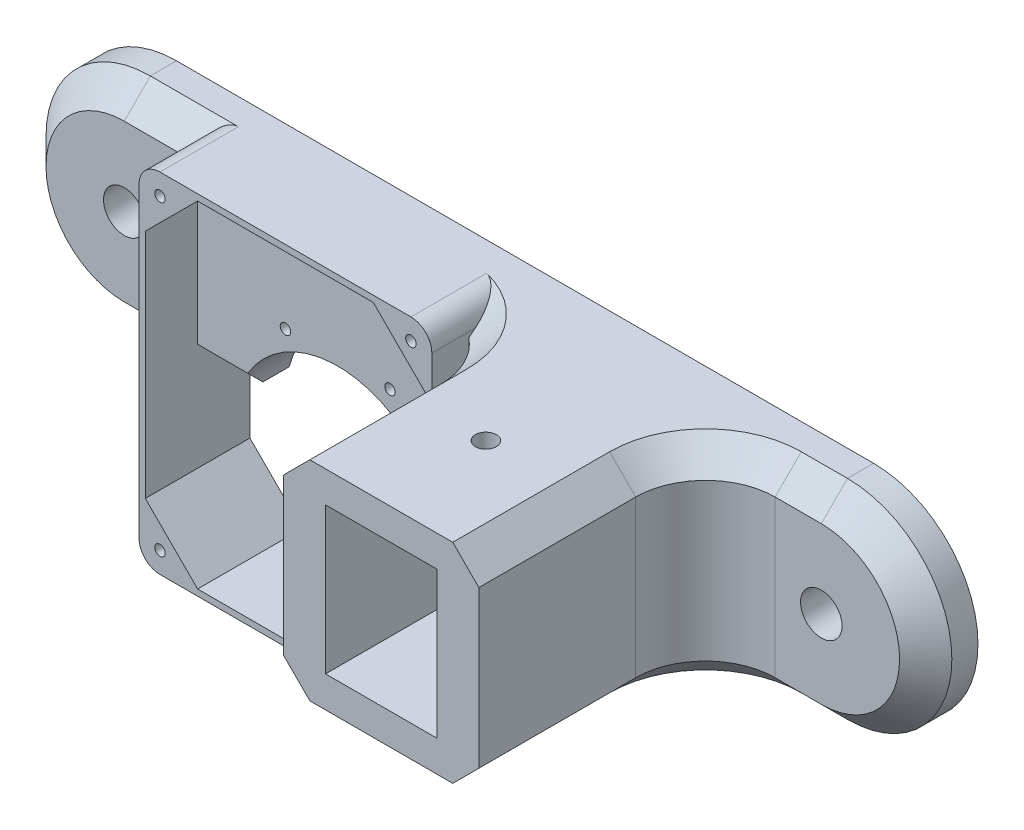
ISO-10303-21;
HEADER;
FILE_DESCRIPTION(('STEP AP214'),'2;1');
FILE_NAME('part.step','',(''),(''),'','','');
FILE_SCHEMA(('AUTOMOTIVE_DESIGN { 1 0 10303 214 1 1 1 1 }'));
ENDSEC;
DATA;
#1=APPLICATION_CONTEXT('core data for automotive mechanical design processes');
#2=APPLICATION_PROTOCOL_DEFINITION('international standard','automotive_design',2000,#1);
#3=PRODUCT_CONTEXT('',#1,'mechanical');
#4=PRODUCT('Part','Part','',(#3));
#5=PRODUCT_RELATED_PRODUCT_CATEGORY('part','',(#4));
#6=PRODUCT_DEFINITION_FORMATION('','',#4);
#7=PRODUCT_DEFINITION_CONTEXT('part definition',#1,'design');
#8=PRODUCT_DEFINITION('design','',#6,#7);
#9=PRODUCT_DEFINITION_SHAPE('','',#8);
#10=(LENGTH_UNIT() NAMED_UNIT(*) SI_UNIT(.MILLI.,.METRE.));
#11=(NAMED_UNIT(*) PLANE_ANGLE_UNIT() SI_UNIT($,.RADIAN.));
#12=(NAMED_UNIT(*) SI_UNIT($,.STERADIAN.) SOLID_ANGLE_UNIT());
#13=UNCERTAINTY_MEASURE_WITH_UNIT(LENGTH_MEASURE(1.E-05),#10,'distance_accuracy_value','');
#14=(GEOMETRIC_REPRESENTATION_CONTEXT(3) GLOBAL_UNCERTAINTY_ASSIGNED_CONTEXT((#13)) GLOBAL_UNIT_ASSIGNED_CONTEXT((#10,
#11,#12)) REPRESENTATION_CONTEXT('',''));
#15=CARTESIAN_POINT('',(0.,0.,0.));
#16=DIRECTION('',(0.,0.,1.));
#17=DIRECTION('',(1.,0.,0.));
#18=AXIS2_PLACEMENT_3D('',#15,#16,#17);
#19=CARTESIAN_POINT('',(100.,-30.95,80.));
#20=DIRECTION('',(0.,1.,0.));
#21=DIRECTION('',(-1.,0.,0.));
#22=AXIS2_PLACEMENT_3D('',#19,#20,#21);
#23=PLANE('',#22);
#24=DIRECTION('',(0.,0.,1.));
#25=VECTOR('',#24,1.);
#26=CARTESIAN_POINT('',(-78.95,-30.9500000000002,80.));
#27=LINE('',#26,#25);
#28=CARTESIAN_POINT('',(-78.95,-30.9500000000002,0.));
#29=VERTEX_POINT('',#28);
#30=CARTESIAN_POINT('',(-78.95,-30.9500000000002,7.50000000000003));
#31=VERTEX_POINT('',#30);
#32=EDGE_CURVE('E729',#29,#31,#27,.T.);
#33=ORIENTED_EDGE('',*,*,#32,.F.);
#34=DIRECTION('',(1.,0.,0.));
#35=VECTOR('',#34,1.);
#36=CARTESIAN_POINT('',(100.,-30.95,0.));
#37=LINE('',#36,#35);
#38=CARTESIAN_POINT('',(-67.718258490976,-30.9500000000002,0.));
#39=VERTEX_POINT('',#38);
#40=EDGE_CURVE('E620',#29,#39,#37,.T.);
#41=ORIENTED_EDGE('',*,*,#40,.T.);
#42=DIRECTION('',(0.,0.,1.));
#43=VECTOR('',#42,1.);
#44=CARTESIAN_POINT('',(-67.718258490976,-30.9500000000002,0.));
#45=LINE('',#44,#43);
#46=CARTESIAN_POINT('',(-67.718258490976,-30.9500000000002,7.50000000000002));
#47=VERTEX_POINT('',#46);
#48=EDGE_CURVE('E713',#39,#47,#45,.T.);
#49=ORIENTED_EDGE('',*,*,#48,.T.);
#50=DIRECTION('',(-1.,0.,0.));
#51=VECTOR('',#50,1.);
#52=CARTESIAN_POINT('',(100.,-30.95,7.50000000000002));
#53=LINE('',#52,#51);
#54=EDGE_CURVE('E875',#47,#31,#53,.T.);
#55=ORIENTED_EDGE('',*,*,#54,.T.);
#56=EDGE_LOOP('',(#33,#41,#49,#55));
#57=FACE_BOUND('',#56,.T.);
#58=ADVANCED_FACE('F33',(#57),#23,.F.);
#59=CARTESIAN_POINT('',(100.,-30.95,7.50000000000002));
#60=DIRECTION('',(0.,0.707106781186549,-0.707106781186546));
#61=DIRECTION('',(-1.,0.,0.));
#62=AXIS2_PLACEMENT_3D('',#59,#60,#61);
#63=PLANE('',#62);
#64=DIRECTION('',(1.,0.,0.));
#65=VECTOR('',#64,1.);
#66=CARTESIAN_POINT('',(-129.95,-23.4500000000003,15.));
#67=LINE('',#66,#65);
#68=CARTESIAN_POINT('',(-78.95,-23.4500000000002,15.));
#69=VERTEX_POINT('',#68);
#70=CARTESIAN_POINT('',(-64.5552320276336,-23.4500000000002,15.));
#71=VERTEX_POINT('',#70);
#72=EDGE_CURVE('E796',#69,#71,#67,.T.);
#73=ORIENTED_EDGE('',*,*,#72,.F.);
#74=DIRECTION('',(0.,0.707106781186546,0.707106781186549));
#75=VECTOR('',#74,1.);
#76=CARTESIAN_POINT('',(-78.95,-30.9500000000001,7.5000000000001));
#77=LINE('',#76,#75);
#78=EDGE_CURVE('E750',#69,#31,#77,.F.);
#79=ORIENTED_EDGE('',*,*,#78,.T.);
#80=ORIENTED_EDGE('',*,*,#54,.F.);
#81=CARTESIAN_POINT('',(-38.75,-38.75,-0.299999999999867));
#82=DIRECTION('',(0.,0.707106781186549,-0.707106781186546));
#83=DIRECTION('',(0.,0.707106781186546,0.707106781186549));
#84=AXIS2_PLACEMENT_3D('',#81,#82,#83);
#85=ELLIPSE('',#84,42.4264068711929,30.);
#86=EDGE_CURVE('E788',#71,#47,#85,.F.);
#87=ORIENTED_EDGE('',*,*,#86,.F.);
#88=EDGE_LOOP('',(#73,#79,#80,#87));
#89=FACE_BOUND('',#88,.T.);
#90=ADVANCED_FACE('F544',(#89),#63,.F.);
#91=DIRECTION('',(0.,0.,-1.));
#92=VECTOR('',#91,1.);
#93=CARTESIAN_POINT('',(1.45000000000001,-30.9500000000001,80.));
#94=LINE('',#93,#92);
#95=CARTESIAN_POINT('',(1.45,-30.9500000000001,9.6670175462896));
#96=VERTEX_POINT('',#95);
#97=CARTESIAN_POINT('',(1.45,-30.9500000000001,0.));
#98=VERTEX_POINT('',#97);
#99=EDGE_CURVE('E478',#96,#98,#94,.T.);
#100=ORIENTED_EDGE('',*,*,#99,.F.);
#101=CARTESIAN_POINT('',(-9.25,-30.9500000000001,35.));
#102=DIRECTION('',(0.,1.,0.));
#103=DIRECTION('',(-1.,0.,0.));
#104=AXIS2_PLACEMENT_3D('',#101,#102,#103);
#105=CIRCLE('',#104,27.5);
#106=CARTESIAN_POINT('',(-9.24999999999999,-30.9500000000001,7.50000000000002));
#107=VERTEX_POINT('',#106);
#108=EDGE_CURVE('E879',#96,#107,#105,.T.);
#109=ORIENTED_EDGE('',*,*,#108,.T.);
#110=CARTESIAN_POINT('',(-9.781741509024,-30.9500000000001,7.50000000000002));
#111=VERTEX_POINT('',#110);
#112=EDGE_CURVE('E876',#107,#111,#53,.T.);
#113=ORIENTED_EDGE('',*,*,#112,.T.);
#114=DIRECTION('',(0.,0.,1.));
#115=VECTOR('',#114,1.);
#116=CARTESIAN_POINT('',(-9.78174150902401,-30.9500000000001,0.));
#117=LINE('',#116,#115);
#118=CARTESIAN_POINT('',(-9.78174150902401,-30.9500000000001,0.));
#119=VERTEX_POINT('',#118);
#120=EDGE_CURVE('E56',#111,#119,#117,.F.);
#121=ORIENTED_EDGE('',*,*,#120,.T.);
#122=EDGE_CURVE('E622',#119,#98,#37,.T.);
#123=ORIENTED_EDGE('',*,*,#122,.T.);
#124=EDGE_LOOP('',(#100,#109,#113,#121,#123));
#125=FACE_BOUND('',#124,.T.);
#126=ADVANCED_FACE('F568',(#125),#23,.F.);
#127=CARTESIAN_POINT('',(-129.95,-30.95,15.));
#128=DIRECTION('',(0.,0.,-1.));
#129=DIRECTION('',(-1.,0.,0.));
#130=AXIS2_PLACEMENT_3D('',#127,#128,#129);
#131=PLANE('',#130);
#132=CARTESIAN_POINT('',(-53.7499999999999,-7.05000000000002,15.));
#133=DIRECTION('',(0.,0.,1.));
#134=DIRECTION('',(1.,0.,0.));
#135=AXIS2_PLACEMENT_3D('',#132,#133,#134);
#136=CIRCLE('',#135,1.5);
#137=CARTESIAN_POINT('',(-52.2499999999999,-7.05000000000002,15.));
#138=VERTEX_POINT('',#137);
#139=EDGE_CURVE('E725',#138,#138,#136,.T.);
#140=ORIENTED_EDGE('',*,*,#139,.F.);
#141=EDGE_LOOP('',(#140));
#142=FACE_BOUND('',#141,.T.);
#143=CARTESIAN_POINT('',(-23.7499999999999,-7.05000000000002,15.));
#144=DIRECTION('',(0.,0.,1.));
#145=DIRECTION('',(1.,0.,0.));
#146=AXIS2_PLACEMENT_3D('',#143,#144,#145);
#147=CIRCLE('',#146,1.5);
#148=CARTESIAN_POINT('',(-22.2499999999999,-7.05000000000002,15.));
#149=VERTEX_POINT('',#148);
#150=EDGE_CURVE('E732',#149,#149,#147,.T.);
#151=ORIENTED_EDGE('',*,*,#150,.F.);
#152=EDGE_LOOP('',(#151));
#153=FACE_BOUND('',#152,.T.);
#154=CARTESIAN_POINT('',(-23.7500000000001,18.95,15.));
#155=DIRECTION('',(0.,0.,1.));
#156=DIRECTION('',(1.,0.,0.));
#157=AXIS2_PLACEMENT_3D('',#154,#155,#156);
#158=CIRCLE('',#157,1.5);
#159=CARTESIAN_POINT('',(-22.2500000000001,18.95,15.));
#160=VERTEX_POINT('',#159);
#161=EDGE_CURVE('E738',#160,#160,#158,.T.);
#162=ORIENTED_EDGE('',*,*,#161,.F.);
#163=EDGE_LOOP('',(#162));
#164=FACE_BOUND('',#163,.T.);
#165=CARTESIAN_POINT('',(-53.7500000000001,18.95,15.));
#166=DIRECTION('',(0.,0.,1.));
#167=DIRECTION('',(1.,0.,0.));
#168=AXIS2_PLACEMENT_3D('',#165,#166,#167);
#169=CIRCLE('',#168,1.5);
#170=CARTESIAN_POINT('',(-52.2500000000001,18.95,15.));
#171=VERTEX_POINT('',#170);
#172=EDGE_CURVE('E744',#171,#171,#169,.T.);
#173=ORIENTED_EDGE('',*,*,#172,.F.);
#174=EDGE_LOOP('',(#173));
#175=FACE_BOUND('',#174,.T.);
#176=DIRECTION('',(0.707106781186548,0.707106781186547,0.));
#177=VECTOR('',#176,1.);
#178=CARTESIAN_POINT('',(-126.,-34.9,15.));
#179=LINE('',#178,#177);
#180=CARTESIAN_POINT('',(-78.95,12.15,15.));
#181=VERTEX_POINT('',#180);
#182=CARTESIAN_POINT('',(-69.65,21.45,15.));
#183=VERTEX_POINT('',#182);
#184=EDGE_CURVE('E761',#181,#183,#179,.T.);
#185=ORIENTED_EDGE('',*,*,#184,.F.);
#186=DIRECTION('',(0.,1.,0.));
#187=VECTOR('',#186,1.);
#188=CARTESIAN_POINT('',(-78.95,-30.95,15.));
#189=LINE('',#188,#187);
#190=EDGE_CURVE('E11',#69,#181,#189,.T.);
#191=ORIENTED_EDGE('',*,*,#190,.F.);
#192=ORIENTED_EDGE('',*,*,#72,.T.);
#193=CARTESIAN_POINT('',(-38.75,-38.75,15.));
#194=DIRECTION('',(0.,0.,1.));
#195=DIRECTION('',(1.,0.,0.));
#196=AXIS2_PLACEMENT_3D('',#193,#194,#195);
#197=CIRCLE('',#196,30.);
#198=CARTESIAN_POINT('',(-12.9447679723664,-23.4500000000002,15.));
#199=VERTEX_POINT('',#198);
#200=EDGE_CURVE('E719',#199,#71,#197,.T.);
#201=ORIENTED_EDGE('',*,*,#200,.F.);
#202=CARTESIAN_POINT('',(-9.25,-23.4500000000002,15.));
#203=VERTEX_POINT('',#202);
#204=EDGE_CURVE('E798',#199,#203,#67,.T.);
#205=ORIENTED_EDGE('',*,*,#204,.T.);
#206=DIRECTION('',(0.,1.,0.));
#207=VECTOR('',#206,1.);
#208=CARTESIAN_POINT('',(-9.25,-30.95,15.));
#209=LINE('',#208,#207);
#210=CARTESIAN_POINT('',(-9.25,21.45,15.));
#211=VERTEX_POINT('',#210);
#212=EDGE_CURVE('E691',#203,#211,#209,.T.);
#213=ORIENTED_EDGE('',*,*,#212,.T.);
#214=DIRECTION('',(-1.,0.,0.));
#215=VECTOR('',#214,1.);
#216=CARTESIAN_POINT('',(-129.95,21.45,15.));
#217=LINE('',#216,#215);
#218=EDGE_CURVE('E776',#211,#183,#217,.T.);
#219=ORIENTED_EDGE('',*,*,#218,.T.);
#220=EDGE_LOOP('',(#185,#191,#192,#201,#205,#213,#219));
#221=FACE_BOUND('',#220,.T.);
#222=ADVANCED_FACE('F579',(#142,#153,#164,#175,#221),#131,.F.);
#223=CARTESIAN_POINT('',(-9.25,-30.95,35.));
#224=DIRECTION('',(0.,1.,0.));
#225=DIRECTION('',(0.,0.,1.));
#226=AXIS2_PLACEMENT_3D('',#223,#224,#225);
#227=CYLINDRICAL_SURFACE('',#226,20.);
#228=DIRECTION('',(0.,1.,0.));
#229=VECTOR('',#228,1.);
#230=CARTESIAN_POINT('',(1.45,-30.95,18.1029588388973));
#231=LINE('',#230,#229);
#232=CARTESIAN_POINT('',(1.45,12.15,18.1029588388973));
#233=VERTEX_POINT('',#232);
#234=CARTESIAN_POINT('',(1.45,-23.4500000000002,18.1029588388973));
#235=VERTEX_POINT('',#234);
#236=EDGE_CURVE('E48',#233,#235,#231,.F.);
#237=ORIENTED_EDGE('',*,*,#236,.F.);
#238=CARTESIAN_POINT('',(-9.25,22.85,35.));
#239=DIRECTION('',(0.707106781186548,0.707106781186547,0.));
#240=DIRECTION('',(-0.707106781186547,0.707106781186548,0.));
#241=AXIS2_PLACEMENT_3D('',#238,#239,#240);
#242=ELLIPSE('',#241,28.2842712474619,20.);
#243=CARTESIAN_POINT('',(-7.85000000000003,21.4500000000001,15.0490601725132));
#244=VERTEX_POINT('',#243);
#245=EDGE_CURVE('E762',#244,#233,#242,.F.);
#246=ORIENTED_EDGE('',*,*,#245,.F.);
#247=CARTESIAN_POINT('',(-9.25,21.4500000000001,35.));
#248=DIRECTION('',(0.,-1.,0.));
#249=DIRECTION('',(0.,0.,-1.));
#250=AXIS2_PLACEMENT_3D('',#247,#248,#249);
#251=CIRCLE('',#250,20.);
#252=EDGE_CURVE('E772',#244,#211,#251,.F.);
#253=ORIENTED_EDGE('',*,*,#252,.T.);
#254=ORIENTED_EDGE('',*,*,#212,.F.);
#255=CARTESIAN_POINT('',(-9.25,-23.4500000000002,35.));
#256=DIRECTION('',(0.,1.,0.));
#257=DIRECTION('',(0.,0.,1.));
#258=AXIS2_PLACEMENT_3D('',#255,#256,#257);
#259=CIRCLE('',#258,20.);
#260=EDGE_CURVE('E860',#203,#235,#259,.F.);
#261=ORIENTED_EDGE('',*,*,#260,.T.);
#262=EDGE_LOOP('',(#237,#246,#253,#254,#261));
#263=FACE_BOUND('',#262,.T.);
#264=ADVANCED_FACE('F1026',(#263),#227,.F.);
#265=CARTESIAN_POINT('',(-9.25,21.4500000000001,35.));
#266=DIRECTION('',(0.,1.,0.));
#267=DIRECTION('',(0.,0.,1.));
#268=AXIS2_PLACEMENT_3D('',#265,#266,#267);
#269=CONICAL_SURFACE('',#268,20.,0.78539816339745);
#270=ORIENTED_EDGE('',*,*,#252,.F.);
#271=CARTESIAN_POINT('',(-7.84980000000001,21.4498,15.0492746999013));
#272=CARTESIAN_POINT('',(-7.9650330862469,21.5650330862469,14.9256714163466));
#273=CARTESIAN_POINT('',(-8.08065649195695,21.680656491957,14.8027968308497));
#274=CARTESIAN_POINT('',(-8.31264175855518,21.9126417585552,14.5584737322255));
#275=CARTESIAN_POINT('',(-8.4290035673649,22.0290035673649,14.4370251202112));
#276=CARTESIAN_POINT('',(-8.66243885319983,22.2624388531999,14.1955061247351));
#277=CARTESIAN_POINT('',(-8.77951232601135,22.3795123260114,14.075435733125));
#278=CARTESIAN_POINT('',(-9.01434877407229,22.6143487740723,13.8366264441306));
#279=CARTESIAN_POINT('',(-9.13211179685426,22.7321117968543,13.7178876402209));
#280=CARTESIAN_POINT('',(-9.2502,22.8502,13.5998000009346));
#281=B_SPLINE_CURVE_WITH_KNOTS('',3,(#271,#272,#273,#274,#275,#276,#277,#278,#279,#280),
.UNSPECIFIED.,.F.,.F.,(4,2,2,2,4),(0.,0.613606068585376,1.22716933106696,1.84072896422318,
2.45433140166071),.UNSPECIFIED.);
#282=CARTESIAN_POINT('',(-9.25,22.85,13.6));
#283=VERTEX_POINT('',#282);
#284=EDGE_CURVE('E492',#244,#283,#281,.T.);
#285=ORIENTED_EDGE('',*,*,#284,.T.);
#286=DIRECTION('',(0.,0.707106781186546,-0.707106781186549));
#287=VECTOR('',#286,1.);
#288=CARTESIAN_POINT('',(-9.25,21.4500000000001,15.));
#289=LINE('',#288,#287);
#290=EDGE_CURVE('E770',#211,#283,#289,.T.);
#291=ORIENTED_EDGE('',*,*,#290,.F.);
#292=EDGE_LOOP('',(#270,#285,#291));
#293=FACE_BOUND('',#292,.T.);
#294=ADVANCED_FACE('F557',(#293),#269,.F.);
#295=CARTESIAN_POINT('',(-129.95,21.45,15.));
#296=DIRECTION('',(0.,-0.707106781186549,-0.707106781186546));
#297=DIRECTION('',(-1.,0.,0.));
#298=AXIS2_PLACEMENT_3D('',#295,#296,#297);
#299=PLANE('',#298);
#300=DIRECTION('',(1.,0.,0.));
#301=VECTOR('',#300,1.);
#302=CARTESIAN_POINT('',(-129.95,27.15,9.29999999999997));
#303=LINE('',#302,#301);
#304=CARTESIAN_POINT('',(-13.55,27.15,9.3));
#305=VERTEX_POINT('',#304);
#306=CARTESIAN_POINT('',(-63.95,27.15,9.3));
#307=VERTEX_POINT('',#306);
#308=EDGE_CURVE('E521',#305,#307,#303,.F.);
#309=ORIENTED_EDGE('',*,*,#308,.T.);
#310=DIRECTION('',(0.577350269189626,0.577350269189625,-0.577350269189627));
#311=VECTOR('',#310,1.);
#312=CARTESIAN_POINT('',(-89.75,1.35000000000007,35.1));
#313=LINE('',#312,#311);
#314=EDGE_CURVE('E352',#307,#183,#313,.F.);
#315=ORIENTED_EDGE('',*,*,#314,.T.);
#316=ORIENTED_EDGE('',*,*,#218,.F.);
#317=ORIENTED_EDGE('',*,*,#290,.T.);
#318=DIRECTION('',(0.577350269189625,-0.577350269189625,0.577350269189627));
#319=VECTOR('',#318,1.);
#320=CARTESIAN_POINT('',(-48.5499999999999,62.1499999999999,-25.7));
#321=LINE('',#320,#319);
#322=EDGE_CURVE('E774',#283,#305,#321,.F.);
#323=ORIENTED_EDGE('',*,*,#322,.T.);
#324=EDGE_LOOP('',(#309,#315,#316,#317,#323));
#325=FACE_BOUND('',#324,.T.);
#326=ADVANCED_FACE('F552',(#325),#299,.F.);
#327=CARTESIAN_POINT('',(-9.25,-30.9500000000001,35.));
#328=DIRECTION('',(0.,-1.,0.));
#329=DIRECTION('',(0.,0.,-1.));
#330=AXIS2_PLACEMENT_3D('',#327,#328,#329);
#331=CONICAL_SURFACE('',#330,27.5,0.78539816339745);
#332=ORIENTED_EDGE('',*,*,#108,.F.);
#333=CARTESIAN_POINT('',(1.45,-45.1804494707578,-5.33534942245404));
#334=CARTESIAN_POINT('',(1.45,-44.3149778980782,-4.4398948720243));
#335=CARTESIAN_POINT('',(1.45,-43.4504382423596,-3.54353669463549));
#336=CARTESIAN_POINT('',(1.45,-41.7237575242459,-1.74849291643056));
#337=CARTESIAN_POINT('',(1.45,-40.8616164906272,-0.849807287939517));
#338=CARTESIAN_POINT('',(1.45,-39.1398883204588,0.950808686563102));
#339=CARTESIAN_POINT('',(1.45,-38.2803025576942,1.85274034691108));
#340=CARTESIAN_POINT('',(1.45,-36.5648758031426,3.66015037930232));
#341=CARTESIAN_POINT('',(1.45,-35.7090347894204,4.56562873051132));
#342=CARTESIAN_POINT('',(1.45,-34.0112400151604,6.37146466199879));
#343=CARTESIAN_POINT('',(1.45,-33.1692353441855,7.27177434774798));
#344=CARTESIAN_POINT('',(1.45,-31.491408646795,9.07813716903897));
#345=CARTESIAN_POINT('',(1.45,-30.6555865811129,9.98419026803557));
#346=CARTESIAN_POINT('',(1.45,-29.4082199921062,11.3489326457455));
#347=CARTESIAN_POINT('',(1.45,-28.9935305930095,11.8047477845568));
#348=CARTESIAN_POINT('',(1.45,-28.1666320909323,12.7186213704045));
#349=CARTESIAN_POINT('',(1.45,-27.7544229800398,13.1766798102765));
#350=CARTESIAN_POINT('',(1.45,-26.9329582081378,14.0954159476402));
#351=CARTESIAN_POINT('',(1.45,-26.5237024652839,14.5560935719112));
#352=CARTESIAN_POINT('',(1.45,-25.70872445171,15.4805615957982));
#353=CARTESIAN_POINT('',(1.45,-25.3030021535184,15.9443519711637));
#354=CARTESIAN_POINT('',(1.45,-24.6574549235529,16.6891969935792));
#355=CARTESIAN_POINT('',(1.45,-24.416254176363,16.9690593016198));
#356=CARTESIAN_POINT('',(1.45,-23.9356046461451,17.5302843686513));
#357=CARTESIAN_POINT('',(1.45,-23.6961558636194,17.8116471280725));
#358=CARTESIAN_POINT('',(1.45,-22.9807491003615,18.6582886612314));
#359=CARTESIAN_POINT('',(1.45,-22.5077616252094,19.226085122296));
#360=CARTESIAN_POINT('',(1.45,-21.5693724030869,20.3735974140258));
#361=CARTESIAN_POINT('',(1.45,-21.104032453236,20.9533640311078));
#362=CARTESIAN_POINT('',(1.45,-20.4167457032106,21.8313479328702));
#363=CARTESIAN_POINT('',(1.45,-20.1894509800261,22.1253798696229));
#364=CARTESIAN_POINT('',(1.45,-19.7390745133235,22.7166493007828));
#365=CARTESIAN_POINT('',(1.45,-19.5159926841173,23.0138867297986));
#366=CARTESIAN_POINT('',(1.45,-19.0727482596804,23.6148423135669));
#367=CARTESIAN_POINT('',(1.45,-18.8526325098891,23.9185950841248));
#368=CARTESIAN_POINT('',(1.45,-18.4184804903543,24.5304303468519));
#369=CARTESIAN_POINT('',(1.45,-18.2044442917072,24.8385128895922));
#370=CARTESIAN_POINT('',(1.45,-17.7835345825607,25.4599512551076));
#371=CARTESIAN_POINT('',(1.45,-17.5766676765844,25.7733115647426));
#372=CARTESIAN_POINT('',(1.45,-17.1719251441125,26.4057983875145));
#373=CARTESIAN_POINT('',(1.45,-16.974049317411,26.7249247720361));
#374=CARTESIAN_POINT('',(1.45,-16.5904917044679,27.3679148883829));
#375=CARTESIAN_POINT('',(1.45,-16.4047450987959,27.6917397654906));
#376=CARTESIAN_POINT('',(1.45,-16.0467745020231,28.3468794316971));
#377=CARTESIAN_POINT('',(1.45,-15.8745522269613,28.6781951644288));
#378=CARTESIAN_POINT('',(1.45,-15.5472303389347,29.3485922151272));
#379=CARTESIAN_POINT('',(1.45,-15.3921038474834,29.6876603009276));
#380=CARTESIAN_POINT('',(1.45,-15.1028049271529,30.3745471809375));
#381=CARTESIAN_POINT('',(1.45,-14.9686238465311,30.7223622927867));
#382=CARTESIAN_POINT('',(1.45,-14.7245938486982,31.4309323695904));
#383=CARTESIAN_POINT('',(1.45,-14.615035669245,31.7917888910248));
#384=CARTESIAN_POINT('',(1.45,-14.4275970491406,32.521719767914));
#385=CARTESIAN_POINT('',(1.45,-14.3497117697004,32.8907928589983));
#386=CARTESIAN_POINT('',(1.45,-14.2308248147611,33.6327616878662));
#387=CARTESIAN_POINT('',(1.45,-14.1896125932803,34.0056230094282));
#388=CARTESIAN_POINT('',(1.45,-14.1463260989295,34.7536241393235));
#389=CARTESIAN_POINT('',(1.45,-14.144247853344,35.1287637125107));
#390=CARTESIAN_POINT('',(1.45,-14.1793472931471,35.8764373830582));
#391=CARTESIAN_POINT('',(1.45,-14.216449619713,36.2489750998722));
#392=CARTESIAN_POINT('',(1.45,-14.3270647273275,36.9885723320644));
#393=CARTESIAN_POINT('',(1.45,-14.4005852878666,37.3556306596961));
#394=CARTESIAN_POINT('',(1.45,-14.5803723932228,38.0857579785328));
#395=CARTESIAN_POINT('',(1.45,-14.6869880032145,38.4487395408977));
#396=CARTESIAN_POINT('',(1.45,-14.9273056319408,39.1656636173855));
#397=CARTESIAN_POINT('',(1.45,-15.0610196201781,39.5196020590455));
#398=CARTESIAN_POINT('',(1.45,-15.3663124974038,40.2567264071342));
#399=CARTESIAN_POINT('',(1.45,-15.5404386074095,40.6388467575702));
#400=CARTESIAN_POINT('',(1.45,-15.9099071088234,41.3927564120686));
#401=CARTESIAN_POINT('',(1.45,-16.1052572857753,41.7645418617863));
#402=CARTESIAN_POINT('',(1.45,-16.4081756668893,42.3107064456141));
#403=CARTESIAN_POINT('',(1.45,-16.5094381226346,42.488630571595));
#404=CARTESIAN_POINT('',(1.45,-16.7154826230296,42.8424311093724));
#405=CARTESIAN_POINT('',(1.45,-16.820264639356,43.0183075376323));
#406=CARTESIAN_POINT('',(1.45,-17.0328114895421,43.3679157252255));
#407=CARTESIAN_POINT('',(1.45,-17.1405720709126,43.541650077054));
#408=CARTESIAN_POINT('',(1.45,-17.3588812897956,43.8873437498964));
#409=CARTESIAN_POINT('',(1.45,-17.4694297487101,44.0593031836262));
#410=CARTESIAN_POINT('',(1.45,-17.5812135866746,44.2304494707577));
#411=B_SPLINE_CURVE_WITH_KNOTS('',3,(#333,#334,#335,#336,#337,#338,#339,#340,#341,#342,#343,
#344,#345,#346,#347,#348,#349,#350,#351,#352,#353,#354,#355,#356,#357,#358,#359,#360,#361,#362,
#363,#364,#365,#366,#367,#368,#369,#370,#371,#372,#373,#374,#375,#376,#377,#378,#379,#380,#381,
#382,#383,#384,#385,#386,#387,#388,#389,#390,#391,#392,#393,#394,#395,#396,#397,#398,#399,#400,
#401,#402,#403,#404,#405,#406,#407,#408,#409,#410),.UNSPECIFIED.,.F.,.F.,(4,2,2,2,2,2,2,2,2,2,2,
2,2,2,2,2,2,2,2,2,2,2,2,2,2,2,2,2,2,2,2,2,2,2,2,2,2,2,4),(0.,3.73603232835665,7.47210928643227,
11.2099233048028,14.9477153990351,18.6457715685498,22.3438042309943,24.1924757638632,
26.0411413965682,27.8897556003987,29.7383554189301,30.8467290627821,31.9551030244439,
34.1719923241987,36.4020582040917,37.5169538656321,38.6318268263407,39.7571314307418,
40.8824491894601,42.0087774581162,43.1350806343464,44.2547657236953,45.3745926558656,
46.4926330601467,47.6102104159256,48.7403612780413,49.8703394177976,50.9937875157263,
52.1171215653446,53.2382989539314,54.3597159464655,55.4933876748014,56.627561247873,
57.8864967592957,59.1458956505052,59.7600311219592,60.3741616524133,60.9874565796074,
61.6007123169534),.UNSPECIFIED.);
#412=EDGE_CURVE('E522',#96,#235,#411,.T.);
#413=ORIENTED_EDGE('',*,*,#412,.T.);
#414=ORIENTED_EDGE('',*,*,#260,.F.);
#415=DIRECTION('',(0.,-0.707106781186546,-0.707106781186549));
#416=VECTOR('',#415,1.);
#417=CARTESIAN_POINT('',(-9.25,-23.4500000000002,15.));
#418=LINE('',#417,#416);
#419=EDGE_CURVE('E818',#203,#107,#418,.T.);
#420=ORIENTED_EDGE('',*,*,#419,.T.);
#421=EDGE_LOOP('',(#332,#413,#414,#420));
#422=FACE_BOUND('',#421,.T.);
#423=ADVANCED_FACE('F537',(#422),#331,.F.);
#424=CARTESIAN_POINT('',(-100.,-30.95,0.));
#425=VERTEX_POINT('',#424);
#426=CARTESIAN_POINT('',(-80.75,-30.9500000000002,0.));
#427=VERTEX_POINT('',#426);
#428=EDGE_CURVE('E611',#425,#427,#37,.T.);
#429=ORIENTED_EDGE('',*,*,#428,.T.);
#430=DIRECTION('',(0.,0.,1.));
#431=VECTOR('',#430,1.);
#432=CARTESIAN_POINT('',(-80.75,-30.9500000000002,80.));
#433=LINE('',#432,#431);
#434=CARTESIAN_POINT('',(-80.75,-30.9500000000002,7.50000000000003));
#435=VERTEX_POINT('',#434);
#436=EDGE_CURVE('E612',#427,#435,#433,.T.);
#437=ORIENTED_EDGE('',*,*,#436,.T.);
#438=CARTESIAN_POINT('',(-100.,-30.95,7.50000000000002));
#439=VERTEX_POINT('',#438);
#440=EDGE_CURVE('E824',#435,#439,#53,.T.);
#441=ORIENTED_EDGE('',*,*,#440,.T.);
#442=DIRECTION('',(0.,0.,-1.));
#443=VECTOR('',#442,1.);
#444=CARTESIAN_POINT('',(-100.,-30.95,80.));
#445=LINE('',#444,#443);
#446=EDGE_CURVE('E615',#439,#425,#445,.T.);
#447=ORIENTED_EDGE('',*,*,#446,.T.);
#448=EDGE_LOOP('',(#429,#437,#441,#447));
#449=FACE_BOUND('',#448,.T.);
#450=ADVANCED_FACE('F581',(#449),#23,.F.);
#451=DIRECTION('',(0.,0.707106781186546,0.707106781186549));
#452=VECTOR('',#451,1.);
#453=CARTESIAN_POINT('',(-80.75,-30.9500000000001,7.50000000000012));
#454=LINE('',#453,#452);
#455=CARTESIAN_POINT('',(-80.75,-23.4500000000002,15.));
#456=VERTEX_POINT('',#455);
#457=EDGE_CURVE('E755',#456,#435,#454,.F.);
#458=ORIENTED_EDGE('',*,*,#457,.F.);
#459=CARTESIAN_POINT('',(-100.,-23.4500000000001,15.));
#460=VERTEX_POINT('',#459);
#461=EDGE_CURVE('E791',#460,#456,#67,.T.);
#462=ORIENTED_EDGE('',*,*,#461,.F.);
#463=DIRECTION('',(0.,-0.707106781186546,-0.707106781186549));
#464=VECTOR('',#463,1.);
#465=CARTESIAN_POINT('',(-100.,-23.4500000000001,15.));
#466=LINE('',#465,#464);
#467=EDGE_CURVE('E784',#460,#439,#466,.T.);
#468=ORIENTED_EDGE('',*,*,#467,.T.);
#469=ORIENTED_EDGE('',*,*,#440,.F.);
#470=EDGE_LOOP('',(#458,#462,#468,#469));
#471=FACE_BOUND('',#470,.T.);
#472=ADVANCED_FACE('F545',(#471),#63,.F.);
#473=CARTESIAN_POINT('',(100.,-0.999999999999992,80.));
#474=DIRECTION('',(0.,0.,1.));
#475=DIRECTION('',(1.,0.,0.));
#476=AXIS2_PLACEMENT_3D('',#473,#474,#475);
#477=PLANE('',#476);
#478=DIRECTION('',(1.,0.,0.));
#479=VECTOR('',#478,1.);
#480=CARTESIAN_POINT('',(-9.25000000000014,-30.95,80.));
#481=LINE('',#480,#479);
#482=CARTESIAN_POINT('',(18.25,-30.95,80.));
#483=VERTEX_POINT('',#482);
#484=CARTESIAN_POINT('',(59.2499999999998,-30.95,80.));
#485=VERTEX_POINT('',#484);
#486=EDGE_CURVE('E624',#483,#485,#481,.T.);
#487=ORIENTED_EDGE('',*,*,#486,.T.);
#488=DIRECTION('',(-0.70710678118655,-0.707106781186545,0.));
#489=VECTOR('',#488,1.);
#490=CARTESIAN_POINT('',(94.6000000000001,4.39999999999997,80.));
#491=LINE('',#490,#489);
#492=CARTESIAN_POINT('',(66.75,-23.4499999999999,80.));
#493=VERTEX_POINT('',#492);
#494=EDGE_CURVE('E903',#485,#493,#491,.F.);
#495=ORIENTED_EDGE('',*,*,#494,.T.);
#496=DIRECTION('',(0.,1.,0.));
#497=VECTOR('',#496,1.);
#498=CARTESIAN_POINT('',(66.75,-30.95,80.));
#499=LINE('',#498,#497);
#500=CARTESIAN_POINT('',(66.75,21.4499999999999,80.));
#501=VERTEX_POINT('',#500);
#502=EDGE_CURVE('E710',#493,#501,#499,.T.);
#503=ORIENTED_EDGE('',*,*,#502,.T.);
#504=DIRECTION('',(0.70710678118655,-0.707106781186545,0.));
#505=VECTOR('',#504,1.);
#506=CARTESIAN_POINT('',(94.6000000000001,-6.39999999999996,80.));
#507=LINE('',#506,#505);
#508=CARTESIAN_POINT('',(59.2499999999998,28.95,80.));
#509=VERTEX_POINT('',#508);
#510=EDGE_CURVE('E901',#501,#509,#507,.F.);
#511=ORIENTED_EDGE('',*,*,#510,.T.);
#512=DIRECTION('',(-1.,0.,0.));
#513=VECTOR('',#512,1.);
#514=CARTESIAN_POINT('',(100.,28.95,80.));
#515=LINE('',#514,#513);
#516=CARTESIAN_POINT('',(18.25,28.95,80.));
#517=VERTEX_POINT('',#516);
#518=EDGE_CURVE('E619',#509,#517,#515,.T.);
#519=ORIENTED_EDGE('',*,*,#518,.T.);
#520=DIRECTION('',(0.707106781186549,0.707106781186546,0.));
#521=VECTOR('',#520,1.);
#522=CARTESIAN_POINT('',(44.1500000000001,54.8500000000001,80.));
#523=LINE('',#522,#521);
#524=CARTESIAN_POINT('',(10.75,21.45,80.));
#525=VERTEX_POINT('',#524);
#526=EDGE_CURVE('E897',#517,#525,#523,.F.);
#527=ORIENTED_EDGE('',*,*,#526,.T.);
#528=DIRECTION('',(0.,1.,0.));
#529=VECTOR('',#528,1.);
#530=CARTESIAN_POINT('',(10.75,-30.95,80.));
#531=LINE('',#530,#529);
#532=CARTESIAN_POINT('',(10.75,-23.4500000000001,80.));
#533=VERTEX_POINT('',#532);
#534=EDGE_CURVE('E684',#533,#525,#531,.T.);
#535=ORIENTED_EDGE('',*,*,#534,.F.);
#536=DIRECTION('',(-0.707106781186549,0.707106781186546,0.));
#537=VECTOR('',#536,1.);
#538=CARTESIAN_POINT('',(44.1500000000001,-56.8500000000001,80.));
#539=LINE('',#538,#537);
#540=EDGE_CURVE('E899',#533,#483,#539,.F.);
#541=ORIENTED_EDGE('',*,*,#540,.T.);
#542=EDGE_LOOP('',(#487,#495,#503,#511,#519,#527,#535,#541));
#543=FACE_BOUND('',#542,.T.);
#544=DIRECTION('',(-1.,0.,0.));
#545=VECTOR('',#544,1.);
#546=CARTESIAN_POINT('',(54.75,20.,80.));
#547=LINE('',#546,#545);
#548=CARTESIAN_POINT('',(54.75,20.,80.));
#549=VERTEX_POINT('',#548);
#550=CARTESIAN_POINT('',(22.75,20.,80.));
#551=VERTEX_POINT('',#550);
#552=EDGE_CURVE('E681',#549,#551,#547,.T.);
#553=ORIENTED_EDGE('',*,*,#552,.F.);
#554=DIRECTION('',(0.,1.,0.));
#555=VECTOR('',#554,1.);
#556=CARTESIAN_POINT('',(54.75,-22.,80.));
#557=LINE('',#556,#555);
#558=CARTESIAN_POINT('',(54.75,-22.,80.));
#559=VERTEX_POINT('',#558);
#560=EDGE_CURVE('E666',#559,#549,#557,.T.);
#561=ORIENTED_EDGE('',*,*,#560,.F.);
#562=DIRECTION('',(1.,0.,0.));
#563=VECTOR('',#562,1.);
#564=CARTESIAN_POINT('',(54.75,-22.,80.));
#565=LINE('',#564,#563);
#566=CARTESIAN_POINT('',(22.75,-22.,80.));
#567=VERTEX_POINT('',#566);
#568=EDGE_CURVE('E662',#567,#559,#565,.T.);
#569=ORIENTED_EDGE('',*,*,#568,.F.);
#570=DIRECTION('',(0.,-1.,0.));
#571=VECTOR('',#570,1.);
#572=CARTESIAN_POINT('',(22.75,-22.,80.));
#573=LINE('',#572,#571);
#574=EDGE_CURVE('E678',#551,#567,#573,.T.);
#575=ORIENTED_EDGE('',*,*,#574,.F.);
#576=EDGE_LOOP('',(#553,#561,#569,#575));
#577=FACE_BOUND('',#576,.T.);
#578=ADVANCED_FACE('F605',(#543,#577),#477,.T.);
#579=CARTESIAN_POINT('',(100.,-0.999999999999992,0.));
#580=DIRECTION('',(0.,0.,1.));
#581=DIRECTION('',(1.,0.,0.));
#582=AXIS2_PLACEMENT_3D('',#579,#580,#581);
#583=PLANE('',#582);
#584=ORIENTED_EDGE('',*,*,#40,.F.);
#585=DIRECTION('',(0.,1.,0.));
#586=VECTOR('',#585,1.);
#587=CARTESIAN_POINT('',(-78.95,-54.25,0.));
#588=LINE('',#587,#586);
#589=CARTESIAN_POINT('',(-78.95,-54.25,0.));
#590=VERTEX_POINT('',#589);
#591=EDGE_CURVE('E371',#590,#29,#588,.T.);
#592=ORIENTED_EDGE('',*,*,#591,.F.);
#593=DIRECTION('',(-0.707106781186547,0.707106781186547,0.));
#594=VECTOR('',#593,1.);
#595=CARTESIAN_POINT('',(-78.95,-54.25,0.));
#596=LINE('',#595,#594);
#597=CARTESIAN_POINT('',(-63.95,-69.25,0.));
#598=VERTEX_POINT('',#597);
#599=EDGE_CURVE('E373',#598,#590,#596,.T.);
#600=ORIENTED_EDGE('',*,*,#599,.F.);
#601=DIRECTION('',(-1.,0.,0.));
#602=VECTOR('',#601,1.);
#603=CARTESIAN_POINT('',(-63.95,-69.25,0.));
#604=LINE('',#603,#602);
#605=CARTESIAN_POINT('',(-13.55,-69.25,0.));
#606=VERTEX_POINT('',#605);
#607=EDGE_CURVE('E397',#606,#598,#604,.T.);
#608=ORIENTED_EDGE('',*,*,#607,.F.);
#609=DIRECTION('',(-0.707106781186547,-0.707106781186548,0.));
#610=VECTOR('',#609,1.);
#611=CARTESIAN_POINT('',(-13.55,-69.25,0.));
#612=LINE('',#611,#610);
#613=CARTESIAN_POINT('',(1.45,-54.25,0.));
#614=VERTEX_POINT('',#613);
#615=EDGE_CURVE('E394',#614,#606,#612,.T.);
#616=ORIENTED_EDGE('',*,*,#615,.F.);
#617=DIRECTION('',(0.,-1.,0.));
#618=VECTOR('',#617,1.);
#619=CARTESIAN_POINT('',(1.45,-54.25,0.));
#620=LINE('',#619,#618);
#621=EDGE_CURVE('E392',#98,#614,#620,.T.);
#622=ORIENTED_EDGE('',*,*,#621,.F.);
#623=ORIENTED_EDGE('',*,*,#122,.F.);
#624=CARTESIAN_POINT('',(-38.75,-38.75,0.));
#625=DIRECTION('',(0.,0.,1.));
#626=DIRECTION('',(1.,0.,0.));
#627=AXIS2_PLACEMENT_3D('',#624,#625,#626);
#628=CIRCLE('',#627,30.);
#629=EDGE_CURVE('E718',#119,#39,#628,.T.);
#630=ORIENTED_EDGE('',*,*,#629,.T.);
#631=EDGE_LOOP('',(#584,#592,#600,#608,#616,#622,#623,#630));
#632=FACE_BOUND('',#631,.T.);
#633=CARTESIAN_POINT('',(-100.,-1.00000000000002,0.));
#634=DIRECTION('',(0.,0.,1.));
#635=DIRECTION('',(1.,0.,0.));
#636=AXIS2_PLACEMENT_3D('',#633,#634,#635);
#637=CIRCLE('',#636,5.94999999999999);
#638=CARTESIAN_POINT('',(-94.05,-1.00000000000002,0.));
#639=VERTEX_POINT('',#638);
#640=EDGE_CURVE('E643',#639,#639,#637,.T.);
#641=ORIENTED_EDGE('',*,*,#640,.T.);
#642=EDGE_LOOP('',(#641));
#643=FACE_BOUND('',#642,.T.);
#644=CARTESIAN_POINT('',(-100.,-1.00000000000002,0.));
#645=DIRECTION('',(0.,0.,1.));
#646=DIRECTION('',(1.,0.,0.));
#647=AXIS2_PLACEMENT_3D('',#644,#645,#646);
#648=CIRCLE('',#647,29.95);
#649=CARTESIAN_POINT('',(-100.,28.95,0.));
#650=VERTEX_POINT('',#649);
#651=EDGE_CURVE('E632',#650,#425,#648,.T.);
#652=ORIENTED_EDGE('',*,*,#651,.F.);
#653=DIRECTION('',(-1.,0.,0.));
#654=VECTOR('',#653,1.);
#655=CARTESIAN_POINT('',(100.,28.95,0.));
#656=LINE('',#655,#654);
#657=CARTESIAN_POINT('',(100.,28.95,0.));
#658=VERTEX_POINT('',#657);
#659=EDGE_CURVE('E636',#658,#650,#656,.T.);
#660=ORIENTED_EDGE('',*,*,#659,.F.);
#661=CARTESIAN_POINT('',(100.,-0.999999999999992,0.));
#662=DIRECTION('',(0.,0.,1.));
#663=DIRECTION('',(1.,0.,0.));
#664=AXIS2_PLACEMENT_3D('',#661,#662,#663);
#665=CIRCLE('',#664,29.95);
#666=CARTESIAN_POINT('',(100.,-30.95,0.));
#667=VERTEX_POINT('',#666);
#668=EDGE_CURVE('E638',#667,#658,#665,.T.);
#669=ORIENTED_EDGE('',*,*,#668,.F.);
#670=CARTESIAN_POINT('',(3.25,-30.9500000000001,0.));
#671=VERTEX_POINT('',#670);
#672=EDGE_CURVE('E626',#671,#667,#37,.T.);
#673=ORIENTED_EDGE('',*,*,#672,.F.);
#674=DIRECTION('',(0.,-1.,0.));
#675=VECTOR('',#674,1.);
#676=CARTESIAN_POINT('',(3.25,-65.05,0.));
#677=LINE('',#676,#675);
#678=CARTESIAN_POINT('',(3.25,-65.05,0.));
#679=VERTEX_POINT('',#678);
#680=EDGE_CURVE('E451',#671,#679,#677,.T.);
#681=ORIENTED_EDGE('',*,*,#680,.T.);
#682=CARTESIAN_POINT('',(-2.75,-65.05,0.));
#683=DIRECTION('',(0.,0.,-1.));
#684=DIRECTION('',(1.,0.,0.));
#685=AXIS2_PLACEMENT_3D('',#682,#683,#684);
#686=CIRCLE('',#685,6.);
#687=CARTESIAN_POINT('',(-2.75,-71.05,0.));
#688=VERTEX_POINT('',#687);
#689=EDGE_CURVE('E453',#679,#688,#686,.T.);
#690=ORIENTED_EDGE('',*,*,#689,.T.);
#691=DIRECTION('',(-1.,0.,0.));
#692=VECTOR('',#691,1.);
#693=CARTESIAN_POINT('',(-74.75,-71.05,0.));
#694=LINE('',#693,#692);
#695=CARTESIAN_POINT('',(-74.75,-71.05,0.));
#696=VERTEX_POINT('',#695);
#697=EDGE_CURVE('E424',#688,#696,#694,.T.);
#698=ORIENTED_EDGE('',*,*,#697,.T.);
#699=CARTESIAN_POINT('',(-74.75,-65.05,0.));
#700=DIRECTION('',(0.,0.,-1.));
#701=DIRECTION('',(1.,0.,0.));
#702=AXIS2_PLACEMENT_3D('',#699,#700,#701);
#703=CIRCLE('',#702,6.00000000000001);
#704=CARTESIAN_POINT('',(-80.75,-65.05,0.));
#705=VERTEX_POINT('',#704);
#706=EDGE_CURVE('E419',#696,#705,#703,.T.);
#707=ORIENTED_EDGE('',*,*,#706,.T.);
#708=DIRECTION('',(0.,1.,0.));
#709=VECTOR('',#708,1.);
#710=CARTESIAN_POINT('',(-80.75,-65.05,0.));
#711=LINE('',#710,#709);
#712=EDGE_CURVE('E448',#705,#427,#711,.T.);
#713=ORIENTED_EDGE('',*,*,#712,.T.);
#714=ORIENTED_EDGE('',*,*,#428,.F.);
#715=EDGE_LOOP('',(#652,#660,#669,#673,#681,#690,#698,#707,#713,#714));
#716=FACE_BOUND('',#715,.T.);
#717=CARTESIAN_POINT('',(-2.75,-65.05,0.));
#718=DIRECTION('',(0.,0.,-1.));
#719=DIRECTION('',(-1.,0.,0.));
#720=AXIS2_PLACEMENT_3D('',#717,#718,#719);
#721=CIRCLE('',#720,1.5);
#722=CARTESIAN_POINT('',(-4.25,-65.05,0.));
#723=VERTEX_POINT('',#722);
#724=EDGE_CURVE('E1004',#723,#723,#721,.T.);
#725=ORIENTED_EDGE('',*,*,#724,.F.);
#726=EDGE_LOOP('',(#725));
#727=FACE_BOUND('',#726,.T.);
#728=CARTESIAN_POINT('',(-74.75,-65.05,0.));
#729=DIRECTION('',(0.,0.,-1.));
#730=DIRECTION('',(-1.,0.,0.));
#731=AXIS2_PLACEMENT_3D('',#728,#729,#730);
#732=CIRCLE('',#731,1.5);
#733=CARTESIAN_POINT('',(-76.25,-65.05,0.));
#734=VERTEX_POINT('',#733);
#735=EDGE_CURVE('E1008',#734,#734,#732,.T.);
#736=ORIENTED_EDGE('',*,*,#735,.F.);
#737=EDGE_LOOP('',(#736));
#738=FACE_BOUND('',#737,.T.);
#739=CARTESIAN_POINT('',(-53.7499999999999,-7.05000000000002,0.));
#740=DIRECTION('',(0.,0.,1.));
#741=DIRECTION('',(1.,0.,0.));
#742=AXIS2_PLACEMENT_3D('',#739,#740,#741);
#743=CIRCLE('',#742,1.5);
#744=CARTESIAN_POINT('',(-52.2499999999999,-7.05000000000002,0.));
#745=VERTEX_POINT('',#744);
#746=EDGE_CURVE('E728',#745,#745,#743,.T.);
#747=ORIENTED_EDGE('',*,*,#746,.T.);
#748=EDGE_LOOP('',(#747));
#749=FACE_BOUND('',#748,.T.);
#750=CARTESIAN_POINT('',(-23.7499999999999,-7.05000000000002,0.));
#751=DIRECTION('',(0.,0.,1.));
#752=DIRECTION('',(1.,0.,0.));
#753=AXIS2_PLACEMENT_3D('',#750,#751,#752);
#754=CIRCLE('',#753,1.5);
#755=CARTESIAN_POINT('',(-22.2499999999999,-7.05000000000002,0.));
#756=VERTEX_POINT('',#755);
#757=EDGE_CURVE('E735',#756,#756,#754,.T.);
#758=ORIENTED_EDGE('',*,*,#757,.T.);
#759=EDGE_LOOP('',(#758));
#760=FACE_BOUND('',#759,.T.);
#761=CARTESIAN_POINT('',(-23.7500000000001,18.95,0.));
#762=DIRECTION('',(0.,0.,1.));
#763=DIRECTION('',(1.,0.,0.));
#764=AXIS2_PLACEMENT_3D('',#761,#762,#763);
#765=CIRCLE('',#764,1.5);
#766=CARTESIAN_POINT('',(-22.2500000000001,18.95,0.));
#767=VERTEX_POINT('',#766);
#768=EDGE_CURVE('E741',#767,#767,#765,.T.);
#769=ORIENTED_EDGE('',*,*,#768,.T.);
#770=EDGE_LOOP('',(#769));
#771=FACE_BOUND('',#770,.T.);
#772=CARTESIAN_POINT('',(-53.7500000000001,18.95,0.));
#773=DIRECTION('',(0.,0.,1.));
#774=DIRECTION('',(1.,0.,0.));
#775=AXIS2_PLACEMENT_3D('',#772,#773,#774);
#776=CIRCLE('',#775,1.5);
#777=CARTESIAN_POINT('',(-52.2500000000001,18.95,0.));
#778=VERTEX_POINT('',#777);
#779=EDGE_CURVE('E722',#778,#778,#776,.T.);
#780=ORIENTED_EDGE('',*,*,#779,.T.);
#781=EDGE_LOOP('',(#780));
#782=FACE_BOUND('',#781,.T.);
#783=DIRECTION('',(0.,1.,0.));
#784=VECTOR('',#783,1.);
#785=CARTESIAN_POINT('',(54.75,-22.,0.));
#786=LINE('',#785,#784);
#787=CARTESIAN_POINT('',(54.75,-22.,0.));
#788=VERTEX_POINT('',#787);
#789=CARTESIAN_POINT('',(54.75,20.,0.));
#790=VERTEX_POINT('',#789);
#791=EDGE_CURVE('E673',#788,#790,#786,.T.);
#792=ORIENTED_EDGE('',*,*,#791,.T.);
#793=DIRECTION('',(-1.,0.,0.));
#794=VECTOR('',#793,1.);
#795=CARTESIAN_POINT('',(54.75,20.,0.));
#796=LINE('',#795,#794);
#797=CARTESIAN_POINT('',(22.75,20.,0.));
#798=VERTEX_POINT('',#797);
#799=EDGE_CURVE('E670',#790,#798,#796,.T.);
#800=ORIENTED_EDGE('',*,*,#799,.T.);
#801=DIRECTION('',(0.,-1.,0.));
#802=VECTOR('',#801,1.);
#803=CARTESIAN_POINT('',(22.75,-22.,0.));
#804=LINE('',#803,#802);
#805=CARTESIAN_POINT('',(22.75,-22.,0.));
#806=VERTEX_POINT('',#805);
#807=EDGE_CURVE('E667',#798,#806,#804,.T.);
#808=ORIENTED_EDGE('',*,*,#807,.T.);
#809=DIRECTION('',(1.,0.,0.));
#810=VECTOR('',#809,1.);
#811=CARTESIAN_POINT('',(54.75,-22.,0.));
#812=LINE('',#811,#810);
#813=EDGE_CURVE('E663',#806,#788,#812,.T.);
#814=ORIENTED_EDGE('',*,*,#813,.T.);
#815=EDGE_LOOP('',(#792,#800,#808,#814));
#816=FACE_BOUND('',#815,.T.);
#817=CARTESIAN_POINT('',(100.,-1.00000000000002,0.));
#818=DIRECTION('',(0.,0.,1.));
#819=DIRECTION('',(-1.,0.,0.));
#820=AXIS2_PLACEMENT_3D('',#817,#818,#819);
#821=CIRCLE('',#820,5.94999999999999);
#822=CARTESIAN_POINT('',(94.05,-1.00000000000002,0.));
#823=VERTEX_POINT('',#822);
#824=EDGE_CURVE('E649',#823,#823,#821,.T.);
#825=ORIENTED_EDGE('',*,*,#824,.T.);
#826=EDGE_LOOP('',(#825));
#827=FACE_BOUND('',#826,.T.);
#828=ADVANCED_FACE('F957',(#632,#643,#716,#727,#738,#749,#760,#771,#782,#816,#827),#583,.F.);
#829=CARTESIAN_POINT('',(100.,-0.999999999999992,80.));
#830=DIRECTION('',(0.,0.,-1.));
#831=DIRECTION('',(-1.,0.,0.));
#832=AXIS2_PLACEMENT_3D('',#829,#830,#831);
#833=CYLINDRICAL_SURFACE('',#832,29.95);
#834=DIRECTION('',(0.,0.,-1.));
#835=VECTOR('',#834,1.);
#836=CARTESIAN_POINT('',(100.,28.95,80.));
#837=LINE('',#836,#835);
#838=CARTESIAN_POINT('',(100.,28.95,7.49999999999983));
#839=VERTEX_POINT('',#838);
#840=EDGE_CURVE('E880',#839,#658,#837,.T.);
#841=ORIENTED_EDGE('',*,*,#840,.F.);
#842=CARTESIAN_POINT('',(100.,-0.999999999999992,7.49999999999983));
#843=DIRECTION('',(0.,0.,-1.));
#844=DIRECTION('',(-1.,0.,0.));
#845=AXIS2_PLACEMENT_3D('',#842,#843,#844);
#846=CIRCLE('',#845,29.95);
#847=CARTESIAN_POINT('',(100.,-30.95,7.49999999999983));
#848=VERTEX_POINT('',#847);
#849=EDGE_CURVE('E837',#839,#848,#846,.T.);
#850=ORIENTED_EDGE('',*,*,#849,.T.);
#851=DIRECTION('',(0.,0.,-1.));
#852=VECTOR('',#851,1.);
#853=CARTESIAN_POINT('',(100.,-30.95,80.));
#854=LINE('',#853,#852);
#855=EDGE_CURVE('E645',#848,#667,#854,.T.);
#856=ORIENTED_EDGE('',*,*,#855,.T.);
#857=ORIENTED_EDGE('',*,*,#668,.T.);
#858=EDGE_LOOP('',(#841,#850,#856,#857));
#859=FACE_BOUND('',#858,.T.);
#860=ADVANCED_FACE('F988',(#859),#833,.T.);
#861=CARTESIAN_POINT('',(100.,28.95,80.));
#862=DIRECTION('',(0.,-1.,0.));
#863=DIRECTION('',(1.,0.,0.));
#864=AXIS2_PLACEMENT_3D('',#861,#862,#863);
#865=PLANE('',#864);
#866=DIRECTION('',(1.,0.,0.));
#867=VECTOR('',#866,1.);
#868=CARTESIAN_POINT('',(100.,28.95,7.50000000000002));
#869=LINE('',#868,#867);
#870=CARTESIAN_POINT('',(-100.,28.95,7.50000000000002));
#871=VERTEX_POINT('',#870);
#872=CARTESIAN_POINT('',(-74.75,28.95,7.49999999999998));
#873=VERTEX_POINT('',#872);
#874=EDGE_CURVE('E833',#871,#873,#869,.T.);
#875=ORIENTED_EDGE('',*,*,#874,.T.);
#876=DIRECTION('',(0.,0.,-1.));
#877=VECTOR('',#876,1.);
#878=CARTESIAN_POINT('',(-74.75,28.95,30.));
#879=LINE('',#878,#877);
#880=CARTESIAN_POINT('',(-74.75,28.95,30.));
#881=VERTEX_POINT('',#880);
#882=EDGE_CURVE('E471',#881,#873,#879,.T.);
#883=ORIENTED_EDGE('',*,*,#882,.F.);
#884=DIRECTION('',(1.,0.,0.));
#885=VECTOR('',#884,1.);
#886=CARTESIAN_POINT('',(-74.75,28.95,30.));
#887=LINE('',#886,#885);
#888=CARTESIAN_POINT('',(-2.75,28.95,30.));
#889=VERTEX_POINT('',#888);
#890=EDGE_CURVE('E430',#881,#889,#887,.T.);
#891=ORIENTED_EDGE('',*,*,#890,.T.);
#892=DIRECTION('',(0.,0.,-1.));
#893=VECTOR('',#892,1.);
#894=CARTESIAN_POINT('',(-2.75,28.95,30.));
#895=LINE('',#894,#893);
#896=CARTESIAN_POINT('',(-2.75,28.95,8.27922156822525));
#897=VERTEX_POINT('',#896);
#898=EDGE_CURVE('E468',#889,#897,#895,.T.);
#899=ORIENTED_EDGE('',*,*,#898,.T.);
#900=CARTESIAN_POINT('',(-9.25,28.95,35.));
#901=DIRECTION('',(0.,-1.,0.));
#902=DIRECTION('',(1.,0.,0.));
#903=AXIS2_PLACEMENT_3D('',#900,#901,#902);
#904=CIRCLE('',#903,27.5);
#905=CARTESIAN_POINT('',(18.25,28.95,35.));
#906=VERTEX_POINT('',#905);
#907=EDGE_CURVE('E836',#897,#906,#904,.T.);
#908=ORIENTED_EDGE('',*,*,#907,.T.);
#909=DIRECTION('',(0.,0.,1.));
#910=VECTOR('',#909,1.);
#911=CARTESIAN_POINT('',(18.25,28.95,80.));
#912=LINE('',#911,#910);
#913=EDGE_CURVE('E839',#906,#517,#912,.T.);
#914=ORIENTED_EDGE('',*,*,#913,.T.);
#915=ORIENTED_EDGE('',*,*,#518,.F.);
#916=DIRECTION('',(0.,0.,-1.));
#917=VECTOR('',#916,1.);
#918=CARTESIAN_POINT('',(59.2499999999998,28.95,80.));
#919=LINE('',#918,#917);
#920=CARTESIAN_POINT('',(59.2499999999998,28.95,35.));
#921=VERTEX_POINT('',#920);
#922=EDGE_CURVE('E848',#509,#921,#919,.T.);
#923=ORIENTED_EDGE('',*,*,#922,.T.);
#924=CARTESIAN_POINT('',(86.75,28.95,35.));
#925=DIRECTION('',(0.,-1.,0.));
#926=DIRECTION('',(1.,0.,0.));
#927=AXIS2_PLACEMENT_3D('',#924,#925,#926);
#928=CIRCLE('',#927,27.5000000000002);
#929=CARTESIAN_POINT('',(86.75,28.95,7.49999999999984));
#930=VERTEX_POINT('',#929);
#931=EDGE_CURVE('E846',#921,#930,#928,.T.);
#932=ORIENTED_EDGE('',*,*,#931,.T.);
#933=DIRECTION('',(1.,0.,0.));
#934=VECTOR('',#933,1.);
#935=CARTESIAN_POINT('',(100.,28.95,7.49999999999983));
#936=LINE('',#935,#934);
#937=EDGE_CURVE('E850',#930,#839,#936,.T.);
#938=ORIENTED_EDGE('',*,*,#937,.T.);
#939=ORIENTED_EDGE('',*,*,#840,.T.);
#940=ORIENTED_EDGE('',*,*,#659,.T.);
#941=DIRECTION('',(0.,0.,-1.));
#942=VECTOR('',#941,1.);
#943=CARTESIAN_POINT('',(-100.,28.95,80.));
#944=LINE('',#943,#942);
#945=EDGE_CURVE('E935',#871,#650,#944,.T.);
#946=ORIENTED_EDGE('',*,*,#945,.F.);
#947=EDGE_LOOP('',(#875,#883,#891,#899,#908,#914,#915,#923,#932,#938,#939,#940,#946));
#948=FACE_BOUND('',#947,.T.);
#949=CARTESIAN_POINT('',(38.75,28.95,50.));
#950=DIRECTION('',(0.,1.,0.));
#951=DIRECTION('',(0.,0.,1.));
#952=AXIS2_PLACEMENT_3D('',#949,#950,#951);
#953=CIRCLE('',#952,3.);
#954=CARTESIAN_POINT('',(38.75,28.95,53.));
#955=VERTEX_POINT('',#954);
#956=EDGE_CURVE('E701',#955,#955,#953,.T.);
#957=ORIENTED_EDGE('',*,*,#956,.F.);
#958=EDGE_LOOP('',(#957));
#959=FACE_BOUND('',#958,.T.);
#960=ADVANCED_FACE('F595',(#948,#959),#865,.F.);
#961=CARTESIAN_POINT('',(-100.,-1.00000000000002,80.));
#962=DIRECTION('',(0.,0.,-1.));
#963=DIRECTION('',(-1.,0.,0.));
#964=AXIS2_PLACEMENT_3D('',#961,#962,#963);
#965=CYLINDRICAL_SURFACE('',#964,29.95);
#966=ORIENTED_EDGE('',*,*,#446,.F.);
#967=CARTESIAN_POINT('',(-100.,-1.00000000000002,7.50000000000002));
#968=DIRECTION('',(0.,0.,-1.));
#969=DIRECTION('',(-1.,0.,0.));
#970=AXIS2_PLACEMENT_3D('',#967,#968,#969);
#971=CIRCLE('',#970,29.95);
#972=EDGE_CURVE('E789',#439,#871,#971,.T.);
#973=ORIENTED_EDGE('',*,*,#972,.T.);
#974=ORIENTED_EDGE('',*,*,#945,.T.);
#975=ORIENTED_EDGE('',*,*,#651,.T.);
#976=EDGE_LOOP('',(#966,#973,#974,#975));
#977=FACE_BOUND('',#976,.T.);
#978=ADVANCED_FACE('F584',(#977),#965,.T.);
#979=CARTESIAN_POINT('',(38.75,-30.95,50.));
#980=DIRECTION('',(0.,1.,0.));
#981=DIRECTION('',(0.,0.,1.));
#982=AXIS2_PLACEMENT_3D('',#979,#980,#981);
#983=CIRCLE('',#982,3.);
#984=CARTESIAN_POINT('',(38.75,-30.95,53.));
#985=VERTEX_POINT('',#984);
#986=EDGE_CURVE('E698',#985,#985,#983,.T.);
#987=ORIENTED_EDGE('',*,*,#986,.T.);
#988=EDGE_LOOP('',(#987));
#989=FACE_BOUND('',#988,.T.);
#990=CARTESIAN_POINT('',(18.25,-30.9500000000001,35.));
#991=VERTEX_POINT('',#990);
#992=CARTESIAN_POINT('',(3.25,-30.9500000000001,10.5051025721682));
#993=VERTEX_POINT('',#992);
#994=EDGE_CURVE('E884',#991,#993,#105,.T.);
#995=ORIENTED_EDGE('',*,*,#994,.T.);
#996=DIRECTION('',(0.,0.,-1.));
#997=VECTOR('',#996,1.);
#998=CARTESIAN_POINT('',(3.25,-30.9500000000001,80.));
#999=LINE('',#998,#997);
#1000=EDGE_CURVE('E483',#993,#671,#999,.T.);
#1001=ORIENTED_EDGE('',*,*,#1000,.T.);
#1002=ORIENTED_EDGE('',*,*,#672,.T.);
#1003=ORIENTED_EDGE('',*,*,#855,.F.);
#1004=DIRECTION('',(-1.,0.,0.));
#1005=VECTOR('',#1004,1.);
#1006=CARTESIAN_POINT('',(100.,-30.95,7.49999999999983));
#1007=LINE('',#1006,#1005);
#1008=CARTESIAN_POINT('',(86.75,-30.95,7.49999999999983));
#1009=VERTEX_POINT('',#1008);
#1010=EDGE_CURVE('E890',#848,#1009,#1007,.T.);
#1011=ORIENTED_EDGE('',*,*,#1010,.T.);
#1012=CARTESIAN_POINT('',(86.75,-30.95,35.));
#1013=DIRECTION('',(0.,1.,0.));
#1014=DIRECTION('',(-1.,0.,0.));
#1015=AXIS2_PLACEMENT_3D('',#1012,#1013,#1014);
#1016=CIRCLE('',#1015,27.5000000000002);
#1017=CARTESIAN_POINT('',(59.2499999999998,-30.95,35.));
#1018=VERTEX_POINT('',#1017);
#1019=EDGE_CURVE('E892',#1009,#1018,#1016,.T.);
#1020=ORIENTED_EDGE('',*,*,#1019,.T.);
#1021=DIRECTION('',(0.,0.,1.));
#1022=VECTOR('',#1021,1.);
#1023=CARTESIAN_POINT('',(59.2499999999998,-30.95,80.));
#1024=LINE('',#1023,#1022);
#1025=EDGE_CURVE('E894',#1018,#485,#1024,.T.);
#1026=ORIENTED_EDGE('',*,*,#1025,.T.);
#1027=ORIENTED_EDGE('',*,*,#486,.F.);
#1028=DIRECTION('',(0.,0.,-1.));
#1029=VECTOR('',#1028,1.);
#1030=CARTESIAN_POINT('',(18.25,-30.9500000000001,80.));
#1031=LINE('',#1030,#1029);
#1032=EDGE_CURVE('E887',#483,#991,#1031,.T.);
#1033=ORIENTED_EDGE('',*,*,#1032,.T.);
#1034=EDGE_LOOP('',(#995,#1001,#1002,#1003,#1011,#1020,#1026,#1027,#1033));
#1035=FACE_BOUND('',#1034,.T.);
#1036=ADVANCED_FACE('F569',(#989,#1035),#23,.F.);
#1037=CARTESIAN_POINT('',(-100.,-1.00000000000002,80.));
#1038=DIRECTION('',(0.,0.,-1.));
#1039=DIRECTION('',(-1.,0.,0.));
#1040=AXIS2_PLACEMENT_3D('',#1037,#1038,#1039);
#1041=CYLINDRICAL_SURFACE('',#1040,5.94999999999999);
#1042=CARTESIAN_POINT('',(-100.,-1.00000000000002,15.));
#1043=DIRECTION('',(0.,0.,-1.));
#1044=DIRECTION('',(-1.,0.,0.));
#1045=AXIS2_PLACEMENT_3D('',#1042,#1043,#1044);
#1046=CIRCLE('',#1045,5.94999999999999);
#1047=CARTESIAN_POINT('',(-105.95,-1.00000000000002,15.));
#1048=VERTEX_POINT('',#1047);
#1049=EDGE_CURVE('E676',#1048,#1048,#1046,.T.);
#1050=ORIENTED_EDGE('',*,*,#1049,.F.);
#1051=EDGE_LOOP('',(#1050));
#1052=FACE_BOUND('',#1051,.T.);
#1053=ORIENTED_EDGE('',*,*,#640,.F.);
#1054=EDGE_LOOP('',(#1053));
#1055=FACE_BOUND('',#1054,.T.);
#1056=ADVANCED_FACE('F583',(#1052,#1055),#1041,.F.);
#1057=CARTESIAN_POINT('',(100.,-1.00000000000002,80.));
#1058=DIRECTION('',(0.,0.,-1.));
#1059=DIRECTION('',(-1.,0.,0.));
#1060=AXIS2_PLACEMENT_3D('',#1057,#1058,#1059);
#1061=CYLINDRICAL_SURFACE('',#1060,5.94999999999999);
#1062=CARTESIAN_POINT('',(100.,-1.00000000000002,15.));
#1063=DIRECTION('',(0.,0.,-1.));
#1064=DIRECTION('',(-1.,0.,0.));
#1065=AXIS2_PLACEMENT_3D('',#1062,#1063,#1064);
#1066=CIRCLE('',#1065,5.94999999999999);
#1067=CARTESIAN_POINT('',(94.05,-1.00000000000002,15.));
#1068=VERTEX_POINT('',#1067);
#1069=EDGE_CURVE('E688',#1068,#1068,#1066,.T.);
#1070=ORIENTED_EDGE('',*,*,#1069,.F.);
#1071=EDGE_LOOP('',(#1070));
#1072=FACE_BOUND('',#1071,.T.);
#1073=ORIENTED_EDGE('',*,*,#824,.F.);
#1074=EDGE_LOOP('',(#1073));
#1075=FACE_BOUND('',#1074,.T.);
#1076=ADVANCED_FACE('F591',(#1072,#1075),#1061,.F.);
#1077=CARTESIAN_POINT('',(54.75,-22.,80.));
#1078=DIRECTION('',(-1.,0.,0.));
#1079=DIRECTION('',(0.,-1.,0.));
#1080=AXIS2_PLACEMENT_3D('',#1077,#1078,#1079);
#1081=PLANE('',#1080);
#1082=ORIENTED_EDGE('',*,*,#791,.F.);
#1083=DIRECTION('',(0.,0.,-1.));
#1084=VECTOR('',#1083,1.);
#1085=CARTESIAN_POINT('',(54.75,-22.,80.));
#1086=LINE('',#1085,#1084);
#1087=EDGE_CURVE('E659',#559,#788,#1086,.T.);
#1088=ORIENTED_EDGE('',*,*,#1087,.F.);
#1089=ORIENTED_EDGE('',*,*,#560,.T.);
#1090=DIRECTION('',(0.,0.,-1.));
#1091=VECTOR('',#1090,1.);
#1092=CARTESIAN_POINT('',(54.75,20.,80.));
#1093=LINE('',#1092,#1091);
#1094=EDGE_CURVE('E652',#549,#790,#1093,.T.);
#1095=ORIENTED_EDGE('',*,*,#1094,.T.);
#1096=EDGE_LOOP('',(#1082,#1088,#1089,#1095));
#1097=FACE_BOUND('',#1096,.T.);
#1098=ADVANCED_FACE('F967',(#1097),#1081,.T.);
#1099=CARTESIAN_POINT('',(54.75,20.,80.));
#1100=DIRECTION('',(0.,-1.,0.));
#1101=DIRECTION('',(1.,0.,0.));
#1102=AXIS2_PLACEMENT_3D('',#1099,#1100,#1101);
#1103=PLANE('',#1102);
#1104=CARTESIAN_POINT('',(38.75,20.,50.));
#1105=DIRECTION('',(0.,-1.,0.));
#1106=DIRECTION('',(1.,0.,0.));
#1107=AXIS2_PLACEMENT_3D('',#1104,#1105,#1106);
#1108=CIRCLE('',#1107,3.);
#1109=CARTESIAN_POINT('',(38.75,20.,53.));
#1110=VERTEX_POINT('',#1109);
#1111=EDGE_CURVE('E694',#1110,#1110,#1108,.T.);
#1112=ORIENTED_EDGE('',*,*,#1111,.F.);
#1113=EDGE_LOOP('',(#1112));
#1114=FACE_BOUND('',#1113,.T.);
#1115=ORIENTED_EDGE('',*,*,#799,.F.);
#1116=ORIENTED_EDGE('',*,*,#1094,.F.);
#1117=ORIENTED_EDGE('',*,*,#552,.T.);
#1118=DIRECTION('',(0.,0.,-1.));
#1119=VECTOR('',#1118,1.);
#1120=CARTESIAN_POINT('',(22.75,20.,80.));
#1121=LINE('',#1120,#1119);
#1122=EDGE_CURVE('E655',#551,#798,#1121,.T.);
#1123=ORIENTED_EDGE('',*,*,#1122,.T.);
#1124=EDGE_LOOP('',(#1115,#1116,#1117,#1123));
#1125=FACE_BOUND('',#1124,.T.);
#1126=ADVANCED_FACE('F970',(#1114,#1125),#1103,.T.);
#1127=CARTESIAN_POINT('',(22.75,-22.,80.));
#1128=DIRECTION('',(1.,0.,0.));
#1129=DIRECTION('',(0.,0.,-1.));
#1130=AXIS2_PLACEMENT_3D('',#1127,#1128,#1129);
#1131=PLANE('',#1130);
#1132=ORIENTED_EDGE('',*,*,#807,.F.);
#1133=ORIENTED_EDGE('',*,*,#1122,.F.);
#1134=ORIENTED_EDGE('',*,*,#574,.T.);
#1135=DIRECTION('',(0.,0.,-1.));
#1136=VECTOR('',#1135,1.);
#1137=CARTESIAN_POINT('',(22.75,-22.,80.));
#1138=LINE('',#1137,#1136);
#1139=EDGE_CURVE('E657',#567,#806,#1138,.T.);
#1140=ORIENTED_EDGE('',*,*,#1139,.T.);
#1141=EDGE_LOOP('',(#1132,#1133,#1134,#1140));
#1142=FACE_BOUND('',#1141,.T.);
#1143=ADVANCED_FACE('F951',(#1142),#1131,.T.);
#1144=CARTESIAN_POINT('',(54.75,-22.,80.));
#1145=DIRECTION('',(0.,1.,0.));
#1146=DIRECTION('',(-1.,0.,0.));
#1147=AXIS2_PLACEMENT_3D('',#1144,#1145,#1146);
#1148=PLANE('',#1147);
#1149=CARTESIAN_POINT('',(38.75,-22.,50.));
#1150=DIRECTION('',(0.,1.,0.));
#1151=DIRECTION('',(-1.,0.,0.));
#1152=AXIS2_PLACEMENT_3D('',#1149,#1150,#1151);
#1153=CIRCLE('',#1152,3.);
#1154=CARTESIAN_POINT('',(38.75,-22.,53.));
#1155=VERTEX_POINT('',#1154);
#1156=EDGE_CURVE('E697',#1155,#1155,#1153,.T.);
#1157=ORIENTED_EDGE('',*,*,#1156,.F.);
#1158=EDGE_LOOP('',(#1157));
#1159=FACE_BOUND('',#1158,.T.);
#1160=ORIENTED_EDGE('',*,*,#813,.F.);
#1161=ORIENTED_EDGE('',*,*,#1139,.F.);
#1162=ORIENTED_EDGE('',*,*,#568,.T.);
#1163=ORIENTED_EDGE('',*,*,#1087,.T.);
#1164=EDGE_LOOP('',(#1160,#1161,#1162,#1163));
#1165=FACE_BOUND('',#1164,.T.);
#1166=ADVANCED_FACE('F947',(#1159,#1165),#1148,.T.);
#1167=ORIENTED_EDGE('',*,*,#1049,.T.);
#1168=EDGE_LOOP('',(#1167));
#1169=FACE_BOUND('',#1168,.T.);
#1170=ORIENTED_EDGE('',*,*,#461,.T.);
#1171=DIRECTION('',(0.,1.,0.));
#1172=VECTOR('',#1171,1.);
#1173=CARTESIAN_POINT('',(-80.75,-30.95,15.));
#1174=LINE('',#1173,#1172);
#1175=CARTESIAN_POINT('',(-80.75,21.45,15.));
#1176=VERTEX_POINT('',#1175);
#1177=EDGE_CURVE('E757',#456,#1176,#1174,.T.);
#1178=ORIENTED_EDGE('',*,*,#1177,.T.);
#1179=CARTESIAN_POINT('',(-100.,21.45,15.));
#1180=VERTEX_POINT('',#1179);
#1181=EDGE_CURVE('E831',#1176,#1180,#217,.T.);
#1182=ORIENTED_EDGE('',*,*,#1181,.T.);
#1183=CARTESIAN_POINT('',(-100.,-1.00000000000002,15.));
#1184=DIRECTION('',(0.,0.,-1.));
#1185=DIRECTION('',(-1.,0.,0.));
#1186=AXIS2_PLACEMENT_3D('',#1183,#1184,#1185);
#1187=CIRCLE('',#1186,22.4500000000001);
#1188=EDGE_CURVE('E826',#1180,#460,#1187,.F.);
#1189=ORIENTED_EDGE('',*,*,#1188,.T.);
#1190=EDGE_LOOP('',(#1170,#1178,#1182,#1189));
#1191=FACE_BOUND('',#1190,.T.);
#1192=ADVANCED_FACE('F950',(#1169,#1191),#131,.F.);
#1193=CARTESIAN_POINT('',(10.75,21.45,35.));
#1194=VERTEX_POINT('',#1193);
#1195=CARTESIAN_POINT('',(3.25,21.45,19.387505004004));
#1196=VERTEX_POINT('',#1195);
#1197=EDGE_CURVE('E856',#1194,#1196,#251,.F.);
#1198=ORIENTED_EDGE('',*,*,#1197,.T.);
#1199=DIRECTION('',(0.,1.,0.));
#1200=VECTOR('',#1199,1.);
#1201=CARTESIAN_POINT('',(3.25,-30.95,19.387505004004));
#1202=LINE('',#1201,#1200);
#1203=CARTESIAN_POINT('',(3.25,-23.4500000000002,19.387505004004));
#1204=VERTEX_POINT('',#1203);
#1205=EDGE_CURVE('E480',#1196,#1204,#1202,.F.);
#1206=ORIENTED_EDGE('',*,*,#1205,.T.);
#1207=CARTESIAN_POINT('',(10.75,-23.4500000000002,35.));
#1208=VERTEX_POINT('',#1207);
#1209=EDGE_CURVE('E859',#1204,#1208,#259,.F.);
#1210=ORIENTED_EDGE('',*,*,#1209,.T.);
#1211=DIRECTION('',(0.,1.,0.));
#1212=VECTOR('',#1211,1.);
#1213=CARTESIAN_POINT('',(10.75,-30.95,35.));
#1214=LINE('',#1213,#1212);
#1215=EDGE_CURVE('E687',#1208,#1194,#1214,.T.);
#1216=ORIENTED_EDGE('',*,*,#1215,.T.);
#1217=EDGE_LOOP('',(#1198,#1206,#1210,#1216));
#1218=FACE_BOUND('',#1217,.T.);
#1219=ADVANCED_FACE('F1034',(#1218),#227,.F.);
#1220=CARTESIAN_POINT('',(10.75,-30.95,80.));
#1221=DIRECTION('',(1.,0.,0.));
#1222=DIRECTION('',(0.,0.,-1.));
#1223=AXIS2_PLACEMENT_3D('',#1220,#1221,#1222);
#1224=PLANE('',#1223);
#1225=ORIENTED_EDGE('',*,*,#1215,.F.);
#1226=DIRECTION('',(0.,0.,1.));
#1227=VECTOR('',#1226,1.);
#1228=CARTESIAN_POINT('',(10.75,-23.4500000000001,80.));
#1229=LINE('',#1228,#1227);
#1230=EDGE_CURVE('E854',#1208,#533,#1229,.T.);
#1231=ORIENTED_EDGE('',*,*,#1230,.T.);
#1232=ORIENTED_EDGE('',*,*,#534,.T.);
#1233=DIRECTION('',(0.,0.,-1.));
#1234=VECTOR('',#1233,1.);
#1235=CARTESIAN_POINT('',(10.75,21.4500000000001,80.));
#1236=LINE('',#1235,#1234);
#1237=EDGE_CURVE('E852',#525,#1194,#1236,.T.);
#1238=ORIENTED_EDGE('',*,*,#1237,.T.);
#1239=EDGE_LOOP('',(#1225,#1231,#1232,#1238));
#1240=FACE_BOUND('',#1239,.T.);
#1241=ADVANCED_FACE('F1042',(#1240),#1224,.F.);
#1242=CARTESIAN_POINT('',(38.75,-30.95,50.));
#1243=DIRECTION('',(0.,1.,0.));
#1244=DIRECTION('',(0.,0.,1.));
#1245=AXIS2_PLACEMENT_3D('',#1242,#1243,#1244);
#1246=CYLINDRICAL_SURFACE('',#1245,3.);
#1247=CARTESIAN_POINT('',(38.75,-22.,53.));
#1248=CARTESIAN_POINT('',(38.75,-22.0932291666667,53.));
#1249=CARTESIAN_POINT('',(38.75,-22.1864583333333,53.));
#1250=CARTESIAN_POINT('',(38.75,-22.3729166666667,53.));
#1251=CARTESIAN_POINT('',(38.75,-22.4661458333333,53.));
#1252=CARTESIAN_POINT('',(38.75,-22.6526041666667,53.));
#1253=CARTESIAN_POINT('',(38.75,-22.7458333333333,53.));
#1254=CARTESIAN_POINT('',(38.75,-22.9322916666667,53.));
#1255=CARTESIAN_POINT('',(38.75,-23.0255208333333,53.));
#1256=CARTESIAN_POINT('',(38.75,-23.2119791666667,53.));
#1257=CARTESIAN_POINT('',(38.75,-23.3052083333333,53.));
#1258=CARTESIAN_POINT('',(38.75,-23.4916666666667,53.));
#1259=CARTESIAN_POINT('',(38.75,-23.5848958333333,53.));
#1260=CARTESIAN_POINT('',(38.75,-23.7713541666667,53.));
#1261=CARTESIAN_POINT('',(38.75,-23.8645833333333,53.));
#1262=CARTESIAN_POINT('',(38.75,-24.0510416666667,53.));
#1263=CARTESIAN_POINT('',(38.75,-24.1442708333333,53.));
#1264=CARTESIAN_POINT('',(38.75,-24.3307291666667,53.));
#1265=CARTESIAN_POINT('',(38.75,-24.4239583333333,53.));
#1266=CARTESIAN_POINT('',(38.75,-24.6104166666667,53.));
#1267=CARTESIAN_POINT('',(38.75,-24.7036458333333,53.));
#1268=CARTESIAN_POINT('',(38.75,-24.8901041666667,53.));
#1269=CARTESIAN_POINT('',(38.75,-24.9833333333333,53.));
#1270=CARTESIAN_POINT('',(38.75,-25.1697916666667,53.));
#1271=CARTESIAN_POINT('',(38.75,-25.2630208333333,53.));
#1272=CARTESIAN_POINT('',(38.75,-25.4494791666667,53.));
#1273=CARTESIAN_POINT('',(38.75,-25.5427083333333,53.));
#1274=CARTESIAN_POINT('',(38.75,-25.7291666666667,53.));
#1275=CARTESIAN_POINT('',(38.75,-25.8223958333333,53.));
#1276=CARTESIAN_POINT('',(38.75,-26.0088541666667,53.));
#1277=CARTESIAN_POINT('',(38.75,-26.1020833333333,53.));
#1278=CARTESIAN_POINT('',(38.75,-26.2885416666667,53.));
#1279=CARTESIAN_POINT('',(38.75,-26.3817708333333,53.));
#1280=CARTESIAN_POINT('',(38.75,-26.5682291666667,53.));
#1281=CARTESIAN_POINT('',(38.75,-26.6614583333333,53.));
#1282=CARTESIAN_POINT('',(38.75,-26.8479166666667,53.));
#1283=CARTESIAN_POINT('',(38.75,-26.9411458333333,53.));
#1284=CARTESIAN_POINT('',(38.75,-27.1276041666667,53.));
#1285=CARTESIAN_POINT('',(38.75,-27.2208333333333,53.));
#1286=CARTESIAN_POINT('',(38.75,-27.4072916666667,53.));
#1287=CARTESIAN_POINT('',(38.75,-27.5005208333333,53.));
#1288=CARTESIAN_POINT('',(38.75,-27.6869791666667,53.));
#1289=CARTESIAN_POINT('',(38.75,-27.7802083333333,53.));
#1290=CARTESIAN_POINT('',(38.75,-27.9666666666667,53.));
#1291=CARTESIAN_POINT('',(38.75,-28.0598958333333,53.));
#1292=CARTESIAN_POINT('',(38.75,-28.2463541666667,53.));
#1293=CARTESIAN_POINT('',(38.75,-28.3395833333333,53.));
#1294=CARTESIAN_POINT('',(38.75,-28.5260416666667,53.));
#1295=CARTESIAN_POINT('',(38.75,-28.6192708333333,53.));
#1296=CARTESIAN_POINT('',(38.75,-28.8057291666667,53.));
#1297=CARTESIAN_POINT('',(38.75,-28.8989583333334,53.));
#1298=CARTESIAN_POINT('',(38.75,-29.0854166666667,53.));
#1299=CARTESIAN_POINT('',(38.75,-29.1786458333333,53.));
#1300=CARTESIAN_POINT('',(38.75,-29.3651041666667,53.));
#1301=CARTESIAN_POINT('',(38.75,-29.4583333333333,53.));
#1302=CARTESIAN_POINT('',(38.75,-29.6447916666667,53.));
#1303=CARTESIAN_POINT('',(38.75,-29.7380208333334,53.));
#1304=CARTESIAN_POINT('',(38.75,-29.9244791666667,53.));
#1305=CARTESIAN_POINT('',(38.75,-30.0177083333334,53.));
#1306=CARTESIAN_POINT('',(38.75,-30.2041666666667,53.));
#1307=CARTESIAN_POINT('',(38.75,-30.2973958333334,53.));
#1308=CARTESIAN_POINT('',(38.75,-30.4838541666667,53.));
#1309=CARTESIAN_POINT('',(38.75,-30.5770833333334,53.));
#1310=CARTESIAN_POINT('',(38.75,-30.7635416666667,53.));
#1311=CARTESIAN_POINT('',(38.75,-30.8567708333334,53.));
#1312=CARTESIAN_POINT('',(38.75,-30.95,53.));
#1313=B_SPLINE_CURVE_WITH_KNOTS('',3,(#1247,#1248,#1249,#1250,#1251,#1252,#1253,#1254,#1255,
#1256,#1257,#1258,#1259,#1260,#1261,#1262,#1263,#1264,#1265,#1266,#1267,#1268,#1269,#1270,#1271,
#1272,#1273,#1274,#1275,#1276,#1277,#1278,#1279,#1280,#1281,#1282,#1283,#1284,#1285,#1286,#1287,
#1288,#1289,#1290,#1291,#1292,#1293,#1294,#1295,#1296,#1297,#1298,#1299,#1300,#1301,#1302,#1303,
#1304,#1305,#1306,#1307,#1308,#1309,#1310,#1311,#1312),.UNSPECIFIED.,.F.,.F.,(4,2,2,2,2,2,2,2,2,
2,2,2,2,2,2,2,2,2,2,2,2,2,2,2,2,2,2,2,2,2,2,2,4),(0.,0.2796875,0.559375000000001,
0.839062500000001,1.11875000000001,1.39843750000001,1.67812500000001,1.95781250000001,
2.23750000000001,2.51718750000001,2.79687500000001,3.07656250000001,3.35625000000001,
3.63593750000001,3.91562500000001,4.19531250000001,4.47500000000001,4.75468750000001,
5.03437500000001,5.31406250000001,5.59375000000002,5.87343750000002,6.15312500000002,
6.43281250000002,6.71250000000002,6.99218750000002,7.27187500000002,7.55156250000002,
7.83125000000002,8.11093750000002,8.39062500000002,8.67031250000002,8.95000000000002),.UNSPECIFIED.);
#1314=EDGE_CURVE('BSEAM944',#1155,#985,#1313,.T.);
#1315=ORIENTED_EDGE('',*,*,#1156,.T.);
#1316=ORIENTED_EDGE('',*,*,#986,.F.);
#1317=ORIENTED_EDGE('',*,*,#1314,.T.);
#1318=ORIENTED_EDGE('',*,*,#1314,.F.);
#1319=EDGE_LOOP('',(#1315,#1317,#1316,#1318));
#1320=FACE_BOUND('',#1319,.T.);
#1321=ADVANCED_FACE('F944',(#1320),#1246,.F.);
#1322=CARTESIAN_POINT('',(38.75,20.,53.));
#1323=CARTESIAN_POINT('',(38.75,20.0932291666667,53.));
#1324=CARTESIAN_POINT('',(38.75,20.1864583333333,53.));
#1325=CARTESIAN_POINT('',(38.75,20.3729166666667,53.));
#1326=CARTESIAN_POINT('',(38.75,20.4661458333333,53.));
#1327=CARTESIAN_POINT('',(38.75,20.6526041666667,53.));
#1328=CARTESIAN_POINT('',(38.75,20.7458333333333,53.));
#1329=CARTESIAN_POINT('',(38.75,20.9322916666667,53.));
#1330=CARTESIAN_POINT('',(38.75,21.0255208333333,53.));
#1331=CARTESIAN_POINT('',(38.75,21.2119791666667,53.));
#1332=CARTESIAN_POINT('',(38.75,21.3052083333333,53.));
#1333=CARTESIAN_POINT('',(38.75,21.4916666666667,53.));
#1334=CARTESIAN_POINT('',(38.75,21.5848958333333,53.));
#1335=CARTESIAN_POINT('',(38.75,21.7713541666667,53.));
#1336=CARTESIAN_POINT('',(38.75,21.8645833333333,53.));
#1337=CARTESIAN_POINT('',(38.75,22.0510416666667,53.));
#1338=CARTESIAN_POINT('',(38.75,22.1442708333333,53.));
#1339=CARTESIAN_POINT('',(38.75,22.3307291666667,53.));
#1340=CARTESIAN_POINT('',(38.75,22.4239583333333,53.));
#1341=CARTESIAN_POINT('',(38.75,22.6104166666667,53.));
#1342=CARTESIAN_POINT('',(38.75,22.7036458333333,53.));
#1343=CARTESIAN_POINT('',(38.75,22.8901041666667,53.));
#1344=CARTESIAN_POINT('',(38.75,22.9833333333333,53.));
#1345=CARTESIAN_POINT('',(38.75,23.1697916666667,53.));
#1346=CARTESIAN_POINT('',(38.75,23.2630208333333,53.));
#1347=CARTESIAN_POINT('',(38.75,23.4494791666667,53.));
#1348=CARTESIAN_POINT('',(38.75,23.5427083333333,53.));
#1349=CARTESIAN_POINT('',(38.75,23.7291666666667,53.));
#1350=CARTESIAN_POINT('',(38.75,23.8223958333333,53.));
#1351=CARTESIAN_POINT('',(38.75,24.0088541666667,53.));
#1352=CARTESIAN_POINT('',(38.75,24.1020833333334,53.));
#1353=CARTESIAN_POINT('',(38.75,24.2885416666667,53.));
#1354=CARTESIAN_POINT('',(38.75,24.3817708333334,53.));
#1355=CARTESIAN_POINT('',(38.75,24.5682291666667,53.));
#1356=CARTESIAN_POINT('',(38.75,24.6614583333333,53.));
#1357=CARTESIAN_POINT('',(38.75,24.8479166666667,53.));
#1358=CARTESIAN_POINT('',(38.75,24.9411458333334,53.));
#1359=CARTESIAN_POINT('',(38.75,25.1276041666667,53.));
#1360=CARTESIAN_POINT('',(38.75,25.2208333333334,53.));
#1361=CARTESIAN_POINT('',(38.75,25.4072916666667,53.));
#1362=CARTESIAN_POINT('',(38.75,25.5005208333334,53.));
#1363=CARTESIAN_POINT('',(38.75,25.6869791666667,53.));
#1364=CARTESIAN_POINT('',(38.75,25.7802083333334,53.));
#1365=CARTESIAN_POINT('',(38.75,25.9666666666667,53.));
#1366=CARTESIAN_POINT('',(38.75,26.0598958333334,53.));
#1367=CARTESIAN_POINT('',(38.75,26.2463541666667,53.));
#1368=CARTESIAN_POINT('',(38.75,26.3395833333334,53.));
#1369=CARTESIAN_POINT('',(38.75,26.5260416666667,53.));
#1370=CARTESIAN_POINT('',(38.75,26.6192708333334,53.));
#1371=CARTESIAN_POINT('',(38.75,26.8057291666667,53.));
#1372=CARTESIAN_POINT('',(38.75,26.8989583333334,53.));
#1373=CARTESIAN_POINT('',(38.75,27.0854166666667,53.));
#1374=CARTESIAN_POINT('',(38.75,27.1786458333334,53.));
#1375=CARTESIAN_POINT('',(38.75,27.3651041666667,53.));
#1376=CARTESIAN_POINT('',(38.75,27.4583333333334,53.));
#1377=CARTESIAN_POINT('',(38.75,27.6447916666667,53.));
#1378=CARTESIAN_POINT('',(38.75,27.7380208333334,53.));
#1379=CARTESIAN_POINT('',(38.75,27.9244791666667,53.));
#1380=CARTESIAN_POINT('',(38.75,28.0177083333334,53.));
#1381=CARTESIAN_POINT('',(38.75,28.2041666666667,53.));
#1382=CARTESIAN_POINT('',(38.75,28.2973958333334,53.));
#1383=CARTESIAN_POINT('',(38.75,28.4838541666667,53.));
#1384=CARTESIAN_POINT('',(38.75,28.5770833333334,53.));
#1385=CARTESIAN_POINT('',(38.75,28.7635416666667,53.));
#1386=CARTESIAN_POINT('',(38.75,28.8567708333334,53.));
#1387=CARTESIAN_POINT('',(38.75,28.95,53.));
#1388=B_SPLINE_CURVE_WITH_KNOTS('',3,(#1322,#1323,#1324,#1325,#1326,#1327,#1328,#1329,#1330,
#1331,#1332,#1333,#1334,#1335,#1336,#1337,#1338,#1339,#1340,#1341,#1342,#1343,#1344,#1345,#1346,
#1347,#1348,#1349,#1350,#1351,#1352,#1353,#1354,#1355,#1356,#1357,#1358,#1359,#1360,#1361,#1362,
#1363,#1364,#1365,#1366,#1367,#1368,#1369,#1370,#1371,#1372,#1373,#1374,#1375,#1376,#1377,#1378,
#1379,#1380,#1381,#1382,#1383,#1384,#1385,#1386,#1387),.UNSPECIFIED.,.F.,.F.,(4,2,2,2,2,2,2,2,2,
2,2,2,2,2,2,2,2,2,2,2,2,2,2,2,2,2,2,2,2,2,2,2,4),(0.,0.2796875,0.559375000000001,
0.839062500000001,1.11875,1.3984375,1.678125,1.9578125,2.2375,2.5171875,2.796875,3.0765625,
3.35625000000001,3.63593750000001,3.91562500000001,4.19531250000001,4.47500000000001,
4.75468750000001,5.03437500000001,5.31406250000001,5.59375000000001,5.87343750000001,
6.15312500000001,6.43281250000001,6.71250000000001,6.99218750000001,7.27187500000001,
7.55156250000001,7.83125000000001,8.11093750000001,8.39062500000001,8.67031250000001,
8.95000000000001),.UNSPECIFIED.);
#1389=EDGE_CURVE('BSEAM1181',#1110,#955,#1388,.T.);
#1390=ORIENTED_EDGE('',*,*,#1111,.T.);
#1391=ORIENTED_EDGE('',*,*,#956,.T.);
#1392=ORIENTED_EDGE('',*,*,#1389,.T.);
#1393=ORIENTED_EDGE('',*,*,#1389,.F.);
#1394=EDGE_LOOP('',(#1390,#1392,#1391,#1393));
#1395=FACE_BOUND('',#1394,.T.);
#1396=ADVANCED_FACE('F1181',(#1395),#1246,.F.);
#1397=CARTESIAN_POINT('',(129.95,-30.95,15.));
#1398=DIRECTION('',(0.,0.,-1.));
#1399=DIRECTION('',(-1.,0.,0.));
#1400=AXIS2_PLACEMENT_3D('',#1397,#1398,#1399);
#1401=PLANE('',#1400);
#1402=ORIENTED_EDGE('',*,*,#1069,.T.);
#1403=EDGE_LOOP('',(#1402));
#1404=FACE_BOUND('',#1403,.T.);
#1405=DIRECTION('',(0.,1.,0.));
#1406=VECTOR('',#1405,1.);
#1407=CARTESIAN_POINT('',(86.75,-30.95,15.));
#1408=LINE('',#1407,#1406);
#1409=CARTESIAN_POINT('',(86.75,-23.4499999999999,15.));
#1410=VERTEX_POINT('',#1409);
#1411=CARTESIAN_POINT('',(86.75,21.4499999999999,15.));
#1412=VERTEX_POINT('',#1411);
#1413=EDGE_CURVE('E700',#1410,#1412,#1408,.T.);
#1414=ORIENTED_EDGE('',*,*,#1413,.F.);
#1415=DIRECTION('',(1.,0.,0.));
#1416=VECTOR('',#1415,1.);
#1417=CARTESIAN_POINT('',(129.95,-23.4499999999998,15.));
#1418=LINE('',#1417,#1416);
#1419=CARTESIAN_POINT('',(100.,-23.4499999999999,15.));
#1420=VERTEX_POINT('',#1419);
#1421=EDGE_CURVE('E841',#1410,#1420,#1418,.T.);
#1422=ORIENTED_EDGE('',*,*,#1421,.T.);
#1423=CARTESIAN_POINT('',(100.,-0.999999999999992,15.));
#1424=DIRECTION('',(0.,0.,-1.));
#1425=DIRECTION('',(-1.,0.,0.));
#1426=AXIS2_PLACEMENT_3D('',#1423,#1424,#1425);
#1427=CIRCLE('',#1426,22.4499999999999);
#1428=CARTESIAN_POINT('',(100.,21.4499999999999,15.));
#1429=VERTEX_POINT('',#1428);
#1430=EDGE_CURVE('E915',#1420,#1429,#1427,.F.);
#1431=ORIENTED_EDGE('',*,*,#1430,.T.);
#1432=DIRECTION('',(-1.,0.,0.));
#1433=VECTOR('',#1432,1.);
#1434=CARTESIAN_POINT('',(129.95,21.4499999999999,15.));
#1435=LINE('',#1434,#1433);
#1436=EDGE_CURVE('E913',#1429,#1412,#1435,.T.);
#1437=ORIENTED_EDGE('',*,*,#1436,.T.);
#1438=EDGE_LOOP('',(#1414,#1422,#1431,#1437));
#1439=FACE_BOUND('',#1438,.T.);
#1440=ADVANCED_FACE('F920',(#1404,#1439),#1401,.F.);
#1441=CARTESIAN_POINT('',(66.75,-30.95,80.));
#1442=DIRECTION('',(-1.,0.,0.));
#1443=DIRECTION('',(0.,0.,1.));
#1444=AXIS2_PLACEMENT_3D('',#1441,#1442,#1443);
#1445=PLANE('',#1444);
#1446=ORIENTED_EDGE('',*,*,#502,.F.);
#1447=DIRECTION('',(0.,0.,-1.));
#1448=VECTOR('',#1447,1.);
#1449=CARTESIAN_POINT('',(66.75,-23.4499999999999,80.));
#1450=LINE('',#1449,#1448);
#1451=CARTESIAN_POINT('',(66.75,-23.4499999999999,35.));
#1452=VERTEX_POINT('',#1451);
#1453=EDGE_CURVE('E907',#493,#1452,#1450,.T.);
#1454=ORIENTED_EDGE('',*,*,#1453,.T.);
#1455=DIRECTION('',(0.,1.,0.));
#1456=VECTOR('',#1455,1.);
#1457=CARTESIAN_POINT('',(66.75,-30.95,35.));
#1458=LINE('',#1457,#1456);
#1459=CARTESIAN_POINT('',(66.75,21.4499999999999,35.));
#1460=VERTEX_POINT('',#1459);
#1461=EDGE_CURVE('E707',#1452,#1460,#1458,.T.);
#1462=ORIENTED_EDGE('',*,*,#1461,.T.);
#1463=DIRECTION('',(0.,0.,1.));
#1464=VECTOR('',#1463,1.);
#1465=CARTESIAN_POINT('',(66.75,21.4499999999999,80.));
#1466=LINE('',#1465,#1464);
#1467=EDGE_CURVE('E905',#1460,#501,#1466,.T.);
#1468=ORIENTED_EDGE('',*,*,#1467,.T.);
#1469=EDGE_LOOP('',(#1446,#1454,#1462,#1468));
#1470=FACE_BOUND('',#1469,.T.);
#1471=ADVANCED_FACE('F1189',(#1470),#1445,.F.);
#1472=CARTESIAN_POINT('',(86.75,-30.95,35.));
#1473=DIRECTION('',(0.,1.,0.));
#1474=DIRECTION('',(0.,0.,1.));
#1475=AXIS2_PLACEMENT_3D('',#1472,#1473,#1474);
#1476=CYLINDRICAL_SURFACE('',#1475,20.);
#1477=ORIENTED_EDGE('',*,*,#1461,.F.);
#1478=CARTESIAN_POINT('',(86.75,-23.4499999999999,35.));
#1479=DIRECTION('',(0.,1.,0.));
#1480=DIRECTION('',(0.,0.,1.));
#1481=AXIS2_PLACEMENT_3D('',#1478,#1479,#1480);
#1482=CIRCLE('',#1481,20.);
#1483=EDGE_CURVE('E911',#1452,#1410,#1482,.F.);
#1484=ORIENTED_EDGE('',*,*,#1483,.T.);
#1485=ORIENTED_EDGE('',*,*,#1413,.T.);
#1486=CARTESIAN_POINT('',(86.75,21.4499999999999,35.));
#1487=DIRECTION('',(0.,-1.,0.));
#1488=DIRECTION('',(0.,0.,-1.));
#1489=AXIS2_PLACEMENT_3D('',#1486,#1487,#1488);
#1490=CIRCLE('',#1489,20.);
#1491=EDGE_CURVE('E909',#1412,#1460,#1490,.F.);
#1492=ORIENTED_EDGE('',*,*,#1491,.T.);
#1493=EDGE_LOOP('',(#1477,#1484,#1485,#1492));
#1494=FACE_BOUND('',#1493,.T.);
#1495=ADVANCED_FACE('F1156',(#1494),#1476,.F.);
#1496=CARTESIAN_POINT('',(66.75,21.4499999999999,80.));
#1497=DIRECTION('',(-0.707106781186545,-0.70710678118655,0.));
#1498=DIRECTION('',(0.,0.,1.));
#1499=AXIS2_PLACEMENT_3D('',#1496,#1497,#1498);
#1500=PLANE('',#1499);
#1501=ORIENTED_EDGE('',*,*,#510,.F.);
#1502=ORIENTED_EDGE('',*,*,#1467,.F.);
#1503=DIRECTION('',(0.70710678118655,-0.707106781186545,0.));
#1504=VECTOR('',#1503,1.);
#1505=CARTESIAN_POINT('',(59.2499999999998,28.95,35.));
#1506=LINE('',#1505,#1504);
#1507=EDGE_CURVE('E704',#921,#1460,#1506,.T.);
#1508=ORIENTED_EDGE('',*,*,#1507,.F.);
#1509=ORIENTED_EDGE('',*,*,#922,.F.);
#1510=EDGE_LOOP('',(#1501,#1502,#1508,#1509));
#1511=FACE_BOUND('',#1510,.T.);
#1512=ADVANCED_FACE('F1143',(#1511),#1500,.F.);
#1513=CARTESIAN_POINT('',(86.75,21.4499999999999,35.));
#1514=DIRECTION('',(0.,1.,0.));
#1515=DIRECTION('',(0.,0.,1.));
#1516=AXIS2_PLACEMENT_3D('',#1513,#1514,#1515);
#1517=CONICAL_SURFACE('',#1516,20.,0.785398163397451);
#1518=ORIENTED_EDGE('',*,*,#1507,.T.);
#1519=ORIENTED_EDGE('',*,*,#1491,.F.);
#1520=DIRECTION('',(0.,-0.707106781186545,0.70710678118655));
#1521=VECTOR('',#1520,1.);
#1522=CARTESIAN_POINT('',(86.75,28.95,7.49999999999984));
#1523=LINE('',#1522,#1521);
#1524=EDGE_CURVE('E812',#930,#1412,#1523,.T.);
#1525=ORIENTED_EDGE('',*,*,#1524,.F.);
#1526=ORIENTED_EDGE('',*,*,#931,.F.);
#1527=EDGE_LOOP('',(#1518,#1519,#1525,#1526));
#1528=FACE_BOUND('',#1527,.T.);
#1529=ADVANCED_FACE('F1151',(#1528),#1517,.F.);
#1530=CARTESIAN_POINT('',(129.95,21.4499999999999,15.));
#1531=DIRECTION('',(0.,-0.70710678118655,-0.707106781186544));
#1532=DIRECTION('',(-1.,0.,0.));
#1533=AXIS2_PLACEMENT_3D('',#1530,#1531,#1532);
#1534=PLANE('',#1533);
#1535=ORIENTED_EDGE('',*,*,#1524,.T.);
#1536=ORIENTED_EDGE('',*,*,#1436,.F.);
#1537=DIRECTION('',(0.,-0.707106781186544,0.70710678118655));
#1538=VECTOR('',#1537,1.);
#1539=CARTESIAN_POINT('',(100.,28.95,7.49999999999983));
#1540=LINE('',#1539,#1538);
#1541=EDGE_CURVE('E809',#839,#1429,#1540,.T.);
#1542=ORIENTED_EDGE('',*,*,#1541,.F.);
#1543=ORIENTED_EDGE('',*,*,#937,.F.);
#1544=EDGE_LOOP('',(#1535,#1536,#1542,#1543));
#1545=FACE_BOUND('',#1544,.T.);
#1546=ADVANCED_FACE('F1153',(#1545),#1534,.F.);
#1547=CARTESIAN_POINT('',(100.,-0.999999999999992,7.49999999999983));
#1548=DIRECTION('',(0.,0.,-1.));
#1549=DIRECTION('',(-1.,0.,0.));
#1550=AXIS2_PLACEMENT_3D('',#1547,#1548,#1549);
#1551=CONICAL_SURFACE('',#1550,29.95,0.785398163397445);
#1552=ORIENTED_EDGE('',*,*,#1541,.T.);
#1553=ORIENTED_EDGE('',*,*,#1430,.F.);
#1554=DIRECTION('',(0.,0.707106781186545,0.70710678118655));
#1555=VECTOR('',#1554,1.);
#1556=CARTESIAN_POINT('',(100.,-30.95,7.49999999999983));
#1557=LINE('',#1556,#1555);
#1558=EDGE_CURVE('E806',#848,#1420,#1557,.T.);
#1559=ORIENTED_EDGE('',*,*,#1558,.F.);
#1560=ORIENTED_EDGE('',*,*,#849,.F.);
#1561=EDGE_LOOP('',(#1552,#1553,#1559,#1560));
#1562=FACE_BOUND('',#1561,.T.);
#1563=ADVANCED_FACE('F926',(#1562),#1551,.T.);
#1564=CARTESIAN_POINT('',(100.,-30.95,7.49999999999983));
#1565=DIRECTION('',(0.,0.70710678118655,-0.707106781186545));
#1566=DIRECTION('',(-1.,0.,0.));
#1567=AXIS2_PLACEMENT_3D('',#1564,#1565,#1566);
#1568=PLANE('',#1567);
#1569=ORIENTED_EDGE('',*,*,#1558,.T.);
#1570=ORIENTED_EDGE('',*,*,#1421,.F.);
#1571=DIRECTION('',(0.,0.707106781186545,0.70710678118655));
#1572=VECTOR('',#1571,1.);
#1573=CARTESIAN_POINT('',(86.75,-30.95,7.49999999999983));
#1574=LINE('',#1573,#1572);
#1575=EDGE_CURVE('E803',#1009,#1410,#1574,.T.);
#1576=ORIENTED_EDGE('',*,*,#1575,.F.);
#1577=ORIENTED_EDGE('',*,*,#1010,.F.);
#1578=EDGE_LOOP('',(#1569,#1570,#1576,#1577));
#1579=FACE_BOUND('',#1578,.T.);
#1580=ADVANCED_FACE('F930',(#1579),#1568,.F.);
#1581=CARTESIAN_POINT('',(86.75,-30.95,35.));
#1582=DIRECTION('',(0.,-1.,0.));
#1583=DIRECTION('',(0.,0.,-1.));
#1584=AXIS2_PLACEMENT_3D('',#1581,#1582,#1583);
#1585=CONICAL_SURFACE('',#1584,27.5000000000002,0.785398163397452);
#1586=ORIENTED_EDGE('',*,*,#1575,.T.);
#1587=ORIENTED_EDGE('',*,*,#1483,.F.);
#1588=DIRECTION('',(0.70710678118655,0.707106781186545,0.));
#1589=VECTOR('',#1588,1.);
#1590=CARTESIAN_POINT('',(59.2499999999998,-30.95,35.));
#1591=LINE('',#1590,#1589);
#1592=EDGE_CURVE('E781',#1018,#1452,#1591,.T.);
#1593=ORIENTED_EDGE('',*,*,#1592,.F.);
#1594=ORIENTED_EDGE('',*,*,#1019,.F.);
#1595=EDGE_LOOP('',(#1586,#1587,#1593,#1594));
#1596=FACE_BOUND('',#1595,.T.);
#1597=ADVANCED_FACE('F1159',(#1596),#1585,.F.);
#1598=CARTESIAN_POINT('',(59.2499999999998,-30.95,80.));
#1599=DIRECTION('',(-0.707106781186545,0.70710678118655,0.));
#1600=DIRECTION('',(0.,0.,1.));
#1601=AXIS2_PLACEMENT_3D('',#1598,#1599,#1600);
#1602=PLANE('',#1601);
#1603=ORIENTED_EDGE('',*,*,#1592,.T.);
#1604=ORIENTED_EDGE('',*,*,#1453,.F.);
#1605=ORIENTED_EDGE('',*,*,#494,.F.);
#1606=ORIENTED_EDGE('',*,*,#1025,.F.);
#1607=EDGE_LOOP('',(#1603,#1604,#1605,#1606));
#1608=FACE_BOUND('',#1607,.T.);
#1609=ADVANCED_FACE('F1163',(#1608),#1602,.F.);
#1610=CARTESIAN_POINT('',(10.75,21.4500000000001,80.));
#1611=DIRECTION('',(0.707106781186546,-0.707106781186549,0.));
#1612=DIRECTION('',(0.,0.,-1.));
#1613=AXIS2_PLACEMENT_3D('',#1610,#1611,#1612);
#1614=PLANE('',#1613);
#1615=ORIENTED_EDGE('',*,*,#526,.F.);
#1616=ORIENTED_EDGE('',*,*,#913,.F.);
#1617=DIRECTION('',(0.707106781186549,0.707106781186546,0.));
#1618=VECTOR('',#1617,1.);
#1619=CARTESIAN_POINT('',(10.75,21.4500000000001,35.));
#1620=LINE('',#1619,#1618);
#1621=EDGE_CURVE('E777',#1194,#906,#1620,.T.);
#1622=ORIENTED_EDGE('',*,*,#1621,.F.);
#1623=ORIENTED_EDGE('',*,*,#1237,.F.);
#1624=EDGE_LOOP('',(#1615,#1616,#1622,#1623));
#1625=FACE_BOUND('',#1624,.T.);
#1626=ADVANCED_FACE('F35',(#1625),#1614,.F.);
#1627=CARTESIAN_POINT('',(3.25,16.5832000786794,43.5301667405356));
#1628=CARTESIAN_POINT('',(3.25,16.4570526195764,43.3063405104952));
#1629=CARTESIAN_POINT('',(3.25,16.3334413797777,43.081062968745));
#1630=CARTESIAN_POINT('',(3.25,16.0920358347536,42.6273362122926));
#1631=CARTESIAN_POINT('',(3.25,15.9742431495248,42.3988861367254));
#1632=CARTESIAN_POINT('',(3.25,15.7448287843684,41.9377420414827));
#1633=CARTESIAN_POINT('',(3.25,15.6332338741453,41.7050346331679));
#1634=CARTESIAN_POINT('',(3.25,15.4176809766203,41.2361402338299));
#1635=CARTESIAN_POINT('',(3.25,15.3137224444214,40.9999534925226));
#1636=CARTESIAN_POINT('',(3.25,15.0117981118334,40.2787398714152));
#1637=CARTESIAN_POINT('',(3.25,14.8272753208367,39.7879403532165));
#1638=CARTESIAN_POINT('',(3.25,14.5040559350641,38.791994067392));
#1639=CARTESIAN_POINT('',(3.25,14.3652868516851,38.2868713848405));
#1640=CARTESIAN_POINT('',(3.25,14.1748301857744,37.4083226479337));
#1641=CARTESIAN_POINT('',(3.25,14.1096267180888,37.0378309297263));
#1642=CARTESIAN_POINT('',(3.25,14.0112242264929,36.2925327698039));
#1643=CARTESIAN_POINT('',(3.25,13.9780255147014,35.9177262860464));
#1644=CARTESIAN_POINT('',(3.25,13.9456255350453,35.1699885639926));
#1645=CARTESIAN_POINT('',(3.25,13.9461226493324,34.7970705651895));
#1646=CARTESIAN_POINT('',(3.25,13.9803211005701,34.0527612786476));
#1647=CARTESIAN_POINT('',(3.25,14.0140256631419,33.6813701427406));
#1648=CARTESIAN_POINT('',(3.25,14.1239886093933,32.8597149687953));
#1649=CARTESIAN_POINT('',(3.25,14.2081151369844,32.4105056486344));
#1650=CARTESIAN_POINT('',(3.25,14.4176809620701,31.521827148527));
#1651=CARTESIAN_POINT('',(3.25,14.5431367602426,31.0823619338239));
#1652=CARTESIAN_POINT('',(3.25,14.7576169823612,30.429946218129));
#1653=CARTESIAN_POINT('',(3.25,14.833882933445,30.2126749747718));
#1654=CARTESIAN_POINT('',(3.25,14.994275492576,29.781041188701));
#1655=CARTESIAN_POINT('',(3.25,15.0784021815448,29.566678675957));
#1656=CARTESIAN_POINT('',(3.25,15.2536631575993,29.1409252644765));
#1657=CARTESIAN_POINT('',(3.25,15.3447953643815,28.9295335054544));
#1658=CARTESIAN_POINT('',(3.25,15.5333335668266,28.5095868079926));
#1659=CARTESIAN_POINT('',(3.25,15.6307393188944,28.3010317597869));
#1660=CARTESIAN_POINT('',(3.25,15.9345747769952,27.6727263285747));
#1661=CARTESIAN_POINT('',(3.25,16.1497547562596,27.2571932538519));
#1662=CARTESIAN_POINT('',(3.25,16.5983676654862,26.4360470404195));
#1663=CARTESIAN_POINT('',(3.25,16.8318062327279,26.0304370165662));
#1664=CARTESIAN_POINT('',(3.25,17.3134418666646,25.227483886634));
#1665=CARTESIAN_POINT('',(3.25,17.5616554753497,24.8301507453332));
#1666=CARTESIAN_POINT('',(3.25,18.0696893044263,24.0430669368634));
#1667=CARTESIAN_POINT('',(3.25,18.3295083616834,23.6533155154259));
#1668=CARTESIAN_POINT('',(3.25,18.859636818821,22.8787174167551));
#1669=CARTESIAN_POINT('',(3.25,19.1299843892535,22.4938969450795));
#1670=CARTESIAN_POINT('',(3.25,19.6784521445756,21.7298385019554));
#1671=CARTESIAN_POINT('',(3.25,19.9565724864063,21.3506006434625));
#1672=CARTESIAN_POINT('',(3.25,20.5190659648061,20.5971515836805));
#1673=CARTESIAN_POINT('',(3.25,20.8034352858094,20.2229375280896));
#1674=CARTESIAN_POINT('',(3.25,21.3775253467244,19.4786488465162));
#1675=CARTESIAN_POINT('',(3.25,21.667246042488,19.1085741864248));
#1676=CARTESIAN_POINT('',(3.25,22.2533367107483,18.3693069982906));
#1677=CARTESIAN_POINT('',(3.25,22.5497398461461,18.0001407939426));
#1678=CARTESIAN_POINT('',(3.25,23.1464384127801,17.2649650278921));
#1679=CARTESIAN_POINT('',(3.25,23.446733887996,16.898955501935));
#1680=CARTESIAN_POINT('',(3.25,24.3526545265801,15.8049665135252));
#1681=CARTESIAN_POINT('',(3.25,24.9632524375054,15.081103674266));
#1682=CARTESIAN_POINT('',(3.25,26.1929810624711,13.6434305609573));
#1683=CARTESIAN_POINT('',(3.25,26.8120902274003,12.9296017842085));
#1684=CARTESIAN_POINT('',(3.25,28.057858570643,11.5086206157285));
#1685=CARTESIAN_POINT('',(3.25,28.6845174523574,10.8014679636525));
#1686=CARTESIAN_POINT('',(3.25,29.9063727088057,9.43433189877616));
#1687=CARTESIAN_POINT('',(3.25,30.5012266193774,8.77404194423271));
#1688=CARTESIAN_POINT('',(3.25,31.6954762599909,7.45701746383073));
#1689=CARTESIAN_POINT('',(3.25,32.2948739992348,6.80028476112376));
#1690=CARTESIAN_POINT('',(3.25,33.4904706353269,5.49731862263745));
#1691=CARTESIAN_POINT('',(3.25,34.0866308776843,4.85104968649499));
#1692=CARTESIAN_POINT('',(3.25,35.281530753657,3.56147990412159));
#1693=CARTESIAN_POINT('',(3.25,35.8802690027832,2.9181777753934));
#1694=CARTESIAN_POINT('',(3.25,36.4801667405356,2.2759632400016));
#1695=B_SPLINE_CURVE_WITH_KNOTS('',3,(#1627,#1628,#1629,#1630,#1631,#1632,#1633,#1634,#1635,
#1636,#1637,#1638,#1639,#1640,#1641,#1642,#1643,#1644,#1645,#1646,#1647,#1648,#1649,#1650,#1651,
#1652,#1653,#1654,#1655,#1656,#1657,#1658,#1659,#1660,#1661,#1662,#1663,#1664,#1665,#1666,#1667,
#1668,#1669,#1670,#1671,#1672,#1673,#1674,#1675,#1676,#1677,#1678,#1679,#1680,#1681,#1682,#1683,
#1684,#1685,#1686,#1687,#1688,#1689,#1690,#1691,#1692,#1693,#1694),.UNSPECIFIED.,.F.,.F.,(4,2,2,
2,2,2,2,2,2,2,2,2,2,2,2,2,2,2,2,2,2,2,2,2,2,2,2,2,2,2,2,2,2,4),(0.,0.770790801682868,
1.54179501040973,2.31590501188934,3.0899597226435,4.66116764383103,6.22987416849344,
7.35719661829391,8.48453006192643,9.60177387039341,10.7191262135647,12.0878758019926,
13.4571725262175,14.1478537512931,14.8385420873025,15.5290261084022,16.2194833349,
17.6226648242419,19.0262812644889,20.431499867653,21.8365779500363,23.2473376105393,
24.6581257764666,26.0680752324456,27.4780130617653,28.8982799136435,30.3185628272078,
33.1594242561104,35.9940809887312,38.8286267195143,41.4947833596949,44.162197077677,
46.7999208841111,49.4363710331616),.UNSPECIFIED.);
#1696=CARTESIAN_POINT('',(3.25,22.95,17.5071443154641));
#1697=VERTEX_POINT('',#1696);
#1698=EDGE_CURVE('E486',#1196,#1697,#1695,.T.);
#1699=ORIENTED_EDGE('',*,*,#1698,.F.);
#1700=ORIENTED_EDGE('',*,*,#1197,.F.);
#1701=ORIENTED_EDGE('',*,*,#1621,.T.);
#1702=ORIENTED_EDGE('',*,*,#907,.F.);
#1703=CARTESIAN_POINT('',(3.21990451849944,22.3498,18.2279064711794));
#1704=CARTESIAN_POINT('',(3.23329790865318,22.4832707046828,18.0715406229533));
#1705=CARTESIAN_POINT('',(3.24210405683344,22.6155795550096,17.9138312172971));
#1706=CARTESIAN_POINT('',(3.25100826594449,22.8779025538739,17.5963289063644));
#1707=CARTESIAN_POINT('',(3.2511083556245,23.0079172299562,17.4365364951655));
#1708=CARTESIAN_POINT('',(3.24307399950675,23.2656997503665,17.1154523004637));
#1709=CARTESIAN_POINT('',(3.23494231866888,23.3934683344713,16.9541610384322));
#1710=CARTESIAN_POINT('',(3.21075566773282,23.6468384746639,16.6304735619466));
#1711=CARTESIAN_POINT('',(3.19470013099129,23.7724398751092,16.4680772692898));
#1712=CARTESIAN_POINT('',(3.13458992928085,24.1485832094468,15.9764880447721));
#1713=CARTESIAN_POINT('',(3.07868166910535,24.3958519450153,15.6461658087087));
#1714=CARTESIAN_POINT('',(2.93627846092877,24.8813796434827,14.9855177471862));
#1715=CARTESIAN_POINT('',(2.84978213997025,25.1196382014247,14.6551919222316));
#1716=CARTESIAN_POINT('',(2.66038620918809,25.5529429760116,14.0442918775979));
#1717=CARTESIAN_POINT('',(2.56160645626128,25.7492931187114,13.763363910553));
#1718=CARTESIAN_POINT('',(2.34037410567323,26.1339167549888,13.2052271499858));
#1719=CARTESIAN_POINT('',(2.2179199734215,26.3221897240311,12.928018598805));
#1720=CARTESIAN_POINT('',(1.94839808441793,26.6885272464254,12.3805730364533));
#1721=CARTESIAN_POINT('',(1.80142469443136,26.8666275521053,12.110313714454));
#1722=CARTESIAN_POINT('',(1.48053538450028,27.2112191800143,11.5785838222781));
#1723=CARTESIAN_POINT('',(1.30663715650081,27.3777180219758,11.3171076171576));
#1724=CARTESIAN_POINT('',(1.0161654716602,27.6226528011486,10.924379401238));
#1725=CARTESIAN_POINT('',(0.910066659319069,27.7063365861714,10.7886033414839));
#1726=CARTESIAN_POINT('',(0.688766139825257,27.8687123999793,10.5215855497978));
#1727=CARTESIAN_POINT('',(0.573566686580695,27.9474056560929,10.3903427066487));
#1728=CARTESIAN_POINT('',(0.333478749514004,28.0990108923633,10.1333177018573));
#1729=CARTESIAN_POINT('',(0.208586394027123,28.171920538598,10.0075377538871));
#1730=CARTESIAN_POINT('',(-0.0512567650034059,28.3108305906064,9.7628368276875));
#1731=CARTESIAN_POINT('',(-0.186205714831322,28.3768322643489,9.6439145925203));
#1732=CARTESIAN_POINT('',(-0.548428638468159,28.5367601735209,9.34756023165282));
#1733=CARTESIAN_POINT('',(-0.783762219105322,28.624610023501,9.17631162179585));
#1734=CARTESIAN_POINT('',(-1.15607262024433,28.7358517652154,8.94187016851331));
#1735=CARTESIAN_POINT('',(-1.28314018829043,28.769466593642,8.86757909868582));
#1736=CARTESIAN_POINT('',(-1.54368397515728,28.8290004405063,8.72751793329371));
#1737=CARTESIAN_POINT('',(-1.67715969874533,28.8549200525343,8.66174718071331));
#1738=CARTESIAN_POINT('',(-1.9337426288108,28.8954630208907,8.54734829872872));
#1739=CARTESIAN_POINT('',(-2.05620087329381,28.9110618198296,8.49761209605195));
#1740=CARTESIAN_POINT('',(-2.30496542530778,28.9347766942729,8.40682734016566));
#1741=CARTESIAN_POINT('',(-2.43126988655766,28.9428963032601,8.36577469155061));
#1742=CARTESIAN_POINT('',(-2.688567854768,28.9510804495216,8.29278983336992));
#1743=CARTESIAN_POINT('',(-2.81960112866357,28.9510379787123,8.2609842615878));
#1744=CARTESIAN_POINT('',(-3.0837285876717,28.9421820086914,8.20792063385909));
#1745=CARTESIAN_POINT('',(-3.21682606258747,28.9333526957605,8.18668169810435));
#1746=CARTESIAN_POINT('',(-3.3502,28.9199045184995,8.17113468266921));
#1747=B_SPLINE_CURVE_WITH_KNOTS('',3,(#1703,#1704,#1705,#1706,#1707,#1708,#1709,#1710,#1711,
#1712,#1713,#1714,#1715,#1716,#1717,#1718,#1719,#1720,#1721,#1722,#1723,#1724,#1725,#1726,#1727,
#1728,#1729,#1730,#1731,#1732,#1733,#1734,#1735,#1736,#1737,#1738,#1739,#1740,#1741,#1742,#1743,
#1744,#1745,#1746),.UNSPECIFIED.,.F.,.F.,(4,2,2,2,2,2,2,2,2,2,2,2,2,2,2,2,2,2,2,2,2,4),(0.,
0.617953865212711,1.23576372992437,1.85336614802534,2.47101273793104,3.71883214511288,
4.96670756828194,6.03597235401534,7.10530647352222,8.17061619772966,9.23522886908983,
9.80963089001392,10.3838910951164,10.9583818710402,11.5327670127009,12.4411166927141,
12.8936109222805,13.3460702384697,13.7448423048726,14.1434258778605,14.5472353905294,
14.9517729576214),.UNSPECIFIED.);
#1748=EDGE_CURVE('E41',#1697,#897,#1747,.T.);
#1749=ORIENTED_EDGE('',*,*,#1748,.F.);
#1750=EDGE_LOOP('',(#1699,#1700,#1701,#1702,#1749));
#1751=FACE_BOUND('',#1750,.T.);
#1752=ADVANCED_FACE('F498',(#1751),#269,.F.);
#1753=CARTESIAN_POINT('',(-74.75,22.95,13.5));
#1754=DIRECTION('',(0.,-0.707106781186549,-0.707106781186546));
#1755=DIRECTION('',(0.,0.707106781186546,-0.707106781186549));
#1756=AXIS2_PLACEMENT_3D('',#1753,#1754,#1755);
#1757=ELLIPSE('',#1756,8.48528137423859,6.00000000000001);
#1758=CARTESIAN_POINT('',(-80.75,22.95,13.5));
#1759=VERTEX_POINT('',#1758);
#1760=EDGE_CURVE('E834',#873,#1759,#1757,.F.);
#1761=ORIENTED_EDGE('',*,*,#1760,.F.);
#1762=ORIENTED_EDGE('',*,*,#874,.F.);
#1763=DIRECTION('',(0.,0.707106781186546,-0.707106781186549));
#1764=VECTOR('',#1763,1.);
#1765=CARTESIAN_POINT('',(-100.,21.45,15.));
#1766=LINE('',#1765,#1764);
#1767=EDGE_CURVE('E778',#1180,#871,#1766,.T.);
#1768=ORIENTED_EDGE('',*,*,#1767,.F.);
#1769=ORIENTED_EDGE('',*,*,#1181,.F.);
#1770=DIRECTION('',(0.,0.707106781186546,-0.707106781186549));
#1771=VECTOR('',#1770,1.);
#1772=CARTESIAN_POINT('',(-80.75,21.45,15.));
#1773=LINE('',#1772,#1771);
#1774=EDGE_CURVE('E1047',#1759,#1176,#1773,.F.);
#1775=ORIENTED_EDGE('',*,*,#1774,.F.);
#1776=EDGE_LOOP('',(#1761,#1762,#1768,#1769,#1775));
#1777=FACE_BOUND('',#1776,.T.);
#1778=ADVANCED_FACE('F547',(#1777),#299,.F.);
#1779=CARTESIAN_POINT('',(-100.,-1.00000000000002,7.50000000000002));
#1780=DIRECTION('',(0.,0.,-1.));
#1781=DIRECTION('',(-1.,0.,0.));
#1782=AXIS2_PLACEMENT_3D('',#1779,#1780,#1781);
#1783=CONICAL_SURFACE('',#1782,29.95,0.785398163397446);
#1784=ORIENTED_EDGE('',*,*,#1767,.T.);
#1785=ORIENTED_EDGE('',*,*,#972,.F.);
#1786=ORIENTED_EDGE('',*,*,#467,.F.);
#1787=ORIENTED_EDGE('',*,*,#1188,.F.);
#1788=EDGE_LOOP('',(#1784,#1785,#1786,#1787));
#1789=FACE_BOUND('',#1788,.T.);
#1790=ADVANCED_FACE('F542',(#1789),#1783,.T.);
#1791=EDGE_CURVE('E787',#111,#199,#85,.F.);
#1792=ORIENTED_EDGE('',*,*,#1791,.F.);
#1793=ORIENTED_EDGE('',*,*,#112,.F.);
#1794=ORIENTED_EDGE('',*,*,#419,.F.);
#1795=ORIENTED_EDGE('',*,*,#204,.F.);
#1796=EDGE_LOOP('',(#1792,#1793,#1794,#1795));
#1797=FACE_BOUND('',#1796,.T.);
#1798=ADVANCED_FACE('F535',(#1797),#63,.F.);
#1799=CARTESIAN_POINT('',(3.25,-45.1804494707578,-4.8143242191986));
#1800=CARTESIAN_POINT('',(3.25,-44.6506846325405,-4.25905545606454));
#1801=CARTESIAN_POINT('',(3.25,-44.1214320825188,-3.70329741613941));
#1802=CARTESIAN_POINT('',(3.25,-43.0641062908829,-2.5906582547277));
#1803=CARTESIAN_POINT('',(3.25,-42.5360330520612,-2.03377713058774));
#1804=CARTESIAN_POINT('',(3.25,-41.4811925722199,-0.91871760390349));
#1805=CARTESIAN_POINT('',(3.25,-40.9544254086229,-0.360539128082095));
#1806=CARTESIAN_POINT('',(3.25,-39.9024276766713,0.757262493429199));
#1807=CARTESIAN_POINT('',(3.25,-39.3771971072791,1.31688563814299));
#1808=CARTESIAN_POINT('',(3.25,-37.8048384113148,2.9974655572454));
#1809=CARTESIAN_POINT('',(3.25,-36.7603328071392,4.12088274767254));
#1810=CARTESIAN_POINT('',(3.25,-35.2007240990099,5.81257423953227));
#1811=CARTESIAN_POINT('',(3.25,-34.6820521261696,6.37755909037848));
#1812=CARTESIAN_POINT('',(3.25,-33.6475328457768,7.51010795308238));
#1813=CARTESIAN_POINT('',(3.25,-33.1316855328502,8.07767196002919));
#1814=CARTESIAN_POINT('',(3.25,-31.9296423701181,9.40807306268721));
#1815=CARTESIAN_POINT('',(3.25,-31.2447682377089,10.1721064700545));
#1816=CARTESIAN_POINT('',(3.25,-29.8826920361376,11.7070306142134));
#1817=CARTESIAN_POINT('',(3.25,-29.2054902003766,12.4779215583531));
#1818=CARTESIAN_POINT('',(3.25,-27.8605039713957,14.0292402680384));
#1819=CARTESIAN_POINT('',(3.25,-27.1927295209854,14.8096766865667));
#1820=CARTESIAN_POINT('',(3.25,-26.2013740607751,15.988950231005));
#1821=CARTESIAN_POINT('',(3.25,-25.8726502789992,16.3834651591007));
#1822=CARTESIAN_POINT('',(3.25,-25.2192536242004,17.1758382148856));
#1823=CARTESIAN_POINT('',(3.25,-24.8945807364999,17.5736963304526));
#1824=CARTESIAN_POINT('',(3.25,-24.2907607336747,18.3227700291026));
#1825=CARTESIAN_POINT('',(3.25,-24.0110449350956,18.6735268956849));
#1826=CARTESIAN_POINT('',(3.25,-23.4559105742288,19.3784234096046));
#1827=CARTESIAN_POINT('',(3.25,-23.1804919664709,19.7325630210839));
#1828=CARTESIAN_POINT('',(3.25,-22.6346360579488,20.444841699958));
#1829=CARTESIAN_POINT('',(3.25,-22.3642003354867,20.8029819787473));
#1830=CARTESIAN_POINT('',(3.25,-21.8293650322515,21.5237453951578));
#1831=CARTESIAN_POINT('',(3.25,-21.5649653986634,21.886368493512));
#1832=CARTESIAN_POINT('',(3.25,-21.043507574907,22.6166700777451));
#1833=CARTESIAN_POINT('',(3.25,-20.7864467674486,22.9843466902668));
#1834=CARTESIAN_POINT('',(3.25,-20.2810949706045,23.7257218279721));
#1835=CARTESIAN_POINT('',(3.25,-20.0328043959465,24.0994206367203));
#1836=CARTESIAN_POINT('',(3.25,-19.5471040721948,24.8535744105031));
#1837=CARTESIAN_POINT('',(3.25,-19.30968870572,25.2340257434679));
#1838=CARTESIAN_POINT('',(3.25,-18.8481668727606,26.0028845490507));
#1839=CARTESIAN_POINT('',(3.25,-18.6240585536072,26.3912909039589));
#1840=CARTESIAN_POINT('',(3.25,-18.1902142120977,27.1811795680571));
#1841=CARTESIAN_POINT('',(3.25,-17.9806445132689,27.5827538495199));
#1842=CARTESIAN_POINT('',(3.25,-17.5826523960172,28.3963834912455));
#1843=CARTESIAN_POINT('',(3.25,-17.3942317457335,28.8084397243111));
#1844=CARTESIAN_POINT('',(3.25,-17.044296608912,29.6429437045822));
#1845=CARTESIAN_POINT('',(3.25,-16.8827275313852,30.0653683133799));
#1846=CARTESIAN_POINT('',(3.25,-16.5924130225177,30.9214138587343));
#1847=CARTESIAN_POINT('',(3.25,-16.4636582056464,31.3550315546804));
#1848=CARTESIAN_POINT('',(3.25,-16.2655523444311,32.1523491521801));
#1849=CARTESIAN_POINT('',(3.25,-16.1896549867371,32.5144130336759));
#1850=CARTESIAN_POINT('',(3.25,-16.0676868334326,33.2435610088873));
#1851=CARTESIAN_POINT('',(3.25,-16.0216118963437,33.6106443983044));
#1852=CARTESIAN_POINT('',(3.25,-15.9616872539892,34.3468334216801));
#1853=CARTESIAN_POINT('',(3.25,-15.9477821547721,34.7159344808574));
#1854=CARTESIAN_POINT('',(3.25,-15.952794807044,35.4539137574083));
#1855=CARTESIAN_POINT('',(3.25,-15.9717130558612,35.8227919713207));
#1856=CARTESIAN_POINT('',(3.25,-16.0411834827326,36.5557737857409));
#1857=CARTESIAN_POINT('',(3.25,-16.0915867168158,36.9198916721));
#1858=CARTESIAN_POINT('',(3.25,-16.2213728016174,37.6428390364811));
#1859=CARTESIAN_POINT('',(3.25,-16.3007582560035,38.0016680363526));
#1860=CARTESIAN_POINT('',(3.25,-16.5782733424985,39.0715131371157));
#1861=CARTESIAN_POINT('',(3.25,-16.8153951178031,39.7725698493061));
#1862=CARTESIAN_POINT('',(3.25,-17.2212780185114,40.7870097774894));
#1863=CARTESIAN_POINT('',(3.25,-17.3615614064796,41.1125945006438));
#1864=CARTESIAN_POINT('',(3.25,-17.6566338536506,41.7572502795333));
#1865=CARTESIAN_POINT('',(3.25,-17.8114246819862,42.0763205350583));
#1866=CARTESIAN_POINT('',(3.25,-18.1311431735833,42.7044356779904));
#1867=CARTESIAN_POINT('',(3.25,-18.2959261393,43.0135550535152));
#1868=CARTESIAN_POINT('',(3.25,-18.6353534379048,43.6260889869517));
#1869=CARTESIAN_POINT('',(3.25,-18.8099915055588,43.9295070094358));
#1870=CARTESIAN_POINT('',(3.25,-18.9886999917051,44.2304494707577));
#1871=B_SPLINE_CURVE_WITH_KNOTS('',3,(#1799,#1800,#1801,#1802,#1803,#1804,#1805,#1806,#1807,
#1808,#1809,#1810,#1811,#1812,#1813,#1814,#1815,#1816,#1817,#1818,#1819,#1820,#1821,#1822,#1823,
#1824,#1825,#1826,#1827,#1828,#1829,#1830,#1831,#1832,#1833,#1834,#1835,#1836,#1837,#1838,#1839,
#1840,#1841,#1842,#1843,#1844,#1845,#1846,#1847,#1848,#1849,#1850,#1851,#1852,#1853,#1854,#1855,
#1856,#1857,#1858,#1859,#1860,#1861,#1862,#1863,#1864,#1865,#1866,#1867,#1868,#1869,#1870),
.UNSPECIFIED.,.F.,.F.,(4,2,2,2,2,2,2,2,2,2,2,2,2,2,2,2,2,2,2,2,2,2,2,2,2,2,2,2,2,2,2,2,2,2,2,4),
(0.,2.30233978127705,4.60468500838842,6.90716360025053,9.20964063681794,13.8114955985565,
16.1123696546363,18.4132393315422,21.4913778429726,24.5696097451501,27.6508764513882,
29.1914113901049,30.7319407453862,32.0778109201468,33.4236668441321,34.7699419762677,
36.1162053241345,37.4619823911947,38.807823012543,40.152960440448,41.4979101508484,
42.8563228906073,44.2148491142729,45.5705786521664,46.9259199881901,48.034621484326,
49.1431689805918,50.2498062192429,51.3564602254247,52.4579182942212,53.559475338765,
55.7725010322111,56.8359020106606,57.8994328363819,58.9501425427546,60.0001916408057),.UNSPECIFIED.);
#1872=EDGE_CURVE('E514',#993,#1204,#1871,.T.);
#1873=ORIENTED_EDGE('',*,*,#1872,.F.);
#1874=ORIENTED_EDGE('',*,*,#994,.F.);
#1875=DIRECTION('',(0.70710678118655,-0.707106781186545,0.));
#1876=VECTOR('',#1875,1.);
#1877=CARTESIAN_POINT('',(10.75,-23.4500000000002,35.));
#1878=LINE('',#1877,#1876);
#1879=EDGE_CURVE('E716',#1208,#991,#1878,.T.);
#1880=ORIENTED_EDGE('',*,*,#1879,.F.);
#1881=ORIENTED_EDGE('',*,*,#1209,.F.);
#1882=EDGE_LOOP('',(#1873,#1874,#1880,#1881));
#1883=FACE_BOUND('',#1882,.T.);
#1884=ADVANCED_FACE('F529',(#1883),#331,.F.);
#1885=CARTESIAN_POINT('',(18.25,-30.9500000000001,80.));
#1886=DIRECTION('',(0.707106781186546,0.707106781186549,0.));
#1887=DIRECTION('',(0.,0.,-1.));
#1888=AXIS2_PLACEMENT_3D('',#1885,#1886,#1887);
#1889=PLANE('',#1888);
#1890=ORIENTED_EDGE('',*,*,#540,.F.);
#1891=ORIENTED_EDGE('',*,*,#1230,.F.);
#1892=ORIENTED_EDGE('',*,*,#1879,.T.);
#1893=ORIENTED_EDGE('',*,*,#1032,.F.);
#1894=EDGE_LOOP('',(#1890,#1891,#1892,#1893));
#1895=FACE_BOUND('',#1894,.T.);
#1896=ADVANCED_FACE('F534',(#1895),#1889,.F.);
#1897=CARTESIAN_POINT('',(-38.75,-38.75,0.));
#1898=DIRECTION('',(0.,0.,1.));
#1899=DIRECTION('',(1.,0.,0.));
#1900=AXIS2_PLACEMENT_3D('',#1897,#1898,#1899);
#1901=CYLINDRICAL_SURFACE('',#1900,30.);
#1902=ORIENTED_EDGE('',*,*,#629,.F.);
#1903=ORIENTED_EDGE('',*,*,#120,.F.);
#1904=ORIENTED_EDGE('',*,*,#1791,.T.);
#1905=ORIENTED_EDGE('',*,*,#200,.T.);
#1906=ORIENTED_EDGE('',*,*,#86,.T.);
#1907=ORIENTED_EDGE('',*,*,#48,.F.);
#1908=EDGE_LOOP('',(#1902,#1903,#1904,#1905,#1906,#1907));
#1909=FACE_BOUND('',#1908,.T.);
#1910=ADVANCED_FACE('F871',(#1909),#1901,.F.);
#1911=CARTESIAN_POINT('',(-53.7499999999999,-7.05000000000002,0.));
#1912=DIRECTION('',(0.,0.,1.));
#1913=DIRECTION('',(1.,0.,0.));
#1914=AXIS2_PLACEMENT_3D('',#1911,#1912,#1913);
#1915=CYLINDRICAL_SURFACE('',#1914,1.5);
#1916=ORIENTED_EDGE('',*,*,#746,.F.);
#1917=EDGE_LOOP('',(#1916));
#1918=FACE_BOUND('',#1917,.T.);
#1919=ORIENTED_EDGE('',*,*,#139,.T.);
#1920=EDGE_LOOP('',(#1919));
#1921=FACE_BOUND('',#1920,.T.);
#1922=ADVANCED_FACE('F1198',(#1918,#1921),#1915,.F.);
#1923=CARTESIAN_POINT('',(-23.7499999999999,-7.05000000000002,0.));
#1924=DIRECTION('',(0.,0.,1.));
#1925=DIRECTION('',(1.,0.,0.));
#1926=AXIS2_PLACEMENT_3D('',#1923,#1924,#1925);
#1927=CYLINDRICAL_SURFACE('',#1926,1.5);
#1928=ORIENTED_EDGE('',*,*,#757,.F.);
#1929=EDGE_LOOP('',(#1928));
#1930=FACE_BOUND('',#1929,.T.);
#1931=ORIENTED_EDGE('',*,*,#150,.T.);
#1932=EDGE_LOOP('',(#1931));
#1933=FACE_BOUND('',#1932,.T.);
#1934=ADVANCED_FACE('F1201',(#1930,#1933),#1927,.F.);
#1935=CARTESIAN_POINT('',(-23.7500000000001,18.95,0.));
#1936=DIRECTION('',(0.,0.,1.));
#1937=DIRECTION('',(1.,0.,0.));
#1938=AXIS2_PLACEMENT_3D('',#1935,#1936,#1937);
#1939=CYLINDRICAL_SURFACE('',#1938,1.5);
#1940=ORIENTED_EDGE('',*,*,#768,.F.);
#1941=EDGE_LOOP('',(#1940));
#1942=FACE_BOUND('',#1941,.T.);
#1943=ORIENTED_EDGE('',*,*,#161,.T.);
#1944=EDGE_LOOP('',(#1943));
#1945=FACE_BOUND('',#1944,.T.);
#1946=ADVANCED_FACE('F1021',(#1942,#1945),#1939,.F.);
#1947=CARTESIAN_POINT('',(-53.7500000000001,18.95,0.));
#1948=DIRECTION('',(0.,0.,1.));
#1949=DIRECTION('',(1.,0.,0.));
#1950=AXIS2_PLACEMENT_3D('',#1947,#1948,#1949);
#1951=CYLINDRICAL_SURFACE('',#1950,1.5);
#1952=ORIENTED_EDGE('',*,*,#779,.F.);
#1953=EDGE_LOOP('',(#1952));
#1954=FACE_BOUND('',#1953,.T.);
#1955=ORIENTED_EDGE('',*,*,#172,.T.);
#1956=EDGE_LOOP('',(#1955));
#1957=FACE_BOUND('',#1956,.T.);
#1958=ADVANCED_FACE('F1017',(#1954,#1957),#1951,.F.);
#1959=CARTESIAN_POINT('',(-78.95,-54.25,30.));
#1960=DIRECTION('',(-1.,0.,0.));
#1961=DIRECTION('',(0.,-1.,0.));
#1962=AXIS2_PLACEMENT_3D('',#1959,#1960,#1961);
#1963=PLANE('',#1962);
#1964=ORIENTED_EDGE('',*,*,#591,.T.);
#1965=ORIENTED_EDGE('',*,*,#32,.T.);
#1966=ORIENTED_EDGE('',*,*,#78,.F.);
#1967=ORIENTED_EDGE('',*,*,#190,.T.);
#1968=DIRECTION('',(0.,0.,-1.));
#1969=VECTOR('',#1968,1.);
#1970=CARTESIAN_POINT('',(-78.95,12.15,30.));
#1971=LINE('',#1970,#1969);
#1972=CARTESIAN_POINT('',(-78.95,12.15,30.));
#1973=VERTEX_POINT('',#1972);
#1974=EDGE_CURVE('E402',#1973,#181,#1971,.T.);
#1975=ORIENTED_EDGE('',*,*,#1974,.F.);
#1976=DIRECTION('',(0.,1.,0.));
#1977=VECTOR('',#1976,1.);
#1978=CARTESIAN_POINT('',(-78.95,-54.25,30.));
#1979=LINE('',#1978,#1977);
#1980=CARTESIAN_POINT('',(-78.95,-54.25,30.));
#1981=VERTEX_POINT('',#1980);
#1982=EDGE_CURVE('E356',#1981,#1973,#1979,.T.);
#1983=ORIENTED_EDGE('',*,*,#1982,.F.);
#1984=DIRECTION('',(0.,0.,-1.));
#1985=VECTOR('',#1984,1.);
#1986=CARTESIAN_POINT('',(-78.95,-54.25,30.));
#1987=LINE('',#1986,#1985);
#1988=EDGE_CURVE('E405',#1981,#590,#1987,.T.);
#1989=ORIENTED_EDGE('',*,*,#1988,.T.);
#1990=EDGE_LOOP('',(#1964,#1965,#1966,#1967,#1975,#1983,#1989));
#1991=FACE_BOUND('',#1990,.T.);
#1992=ADVANCED_FACE('F1020',(#1991),#1963,.F.);
#1993=CARTESIAN_POINT('',(-80.75,-65.05,30.));
#1994=DIRECTION('',(-1.,0.,0.));
#1995=DIRECTION('',(0.,0.,1.));
#1996=AXIS2_PLACEMENT_3D('',#1993,#1994,#1995);
#1997=PLANE('',#1996);
#1998=ORIENTED_EDGE('',*,*,#436,.F.);
#1999=ORIENTED_EDGE('',*,*,#712,.F.);
#2000=DIRECTION('',(0.,0.,-1.));
#2001=VECTOR('',#2000,1.);
#2002=CARTESIAN_POINT('',(-80.75,-65.05,30.));
#2003=LINE('',#2002,#2001);
#2004=CARTESIAN_POINT('',(-80.75,-65.05,30.));
#2005=VERTEX_POINT('',#2004);
#2006=EDGE_CURVE('E445',#2005,#705,#2003,.T.);
#2007=ORIENTED_EDGE('',*,*,#2006,.F.);
#2008=DIRECTION('',(0.,1.,0.));
#2009=VECTOR('',#2008,1.);
#2010=CARTESIAN_POINT('',(-80.75,-65.05,30.));
#2011=LINE('',#2010,#2009);
#2012=CARTESIAN_POINT('',(-80.75,22.95,30.));
#2013=VERTEX_POINT('',#2012);
#2014=EDGE_CURVE('E423',#2005,#2013,#2011,.T.);
#2015=ORIENTED_EDGE('',*,*,#2014,.T.);
#2016=DIRECTION('',(0.,0.,-1.));
#2017=VECTOR('',#2016,1.);
#2018=CARTESIAN_POINT('',(-80.75,22.95,30.));
#2019=LINE('',#2018,#2017);
#2020=EDGE_CURVE('E473',#2013,#1759,#2019,.T.);
#2021=ORIENTED_EDGE('',*,*,#2020,.T.);
#2022=ORIENTED_EDGE('',*,*,#1774,.T.);
#2023=ORIENTED_EDGE('',*,*,#1177,.F.);
#2024=ORIENTED_EDGE('',*,*,#457,.T.);
#2025=EDGE_LOOP('',(#1998,#1999,#2007,#2015,#2021,#2022,#2023,#2024));
#2026=FACE_BOUND('',#2025,.T.);
#2027=ADVANCED_FACE('F1046',(#2026),#1997,.T.);
#2028=CARTESIAN_POINT('',(-78.95,12.15,30.));
#2029=DIRECTION('',(-0.707106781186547,0.707106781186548,0.));
#2030=DIRECTION('',(-0.707106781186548,-0.707106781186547,0.));
#2031=AXIS2_PLACEMENT_3D('',#2028,#2029,#2030);
#2032=PLANE('',#2031);
#2033=ORIENTED_EDGE('',*,*,#1974,.T.);
#2034=ORIENTED_EDGE('',*,*,#184,.T.);
#2035=ORIENTED_EDGE('',*,*,#314,.F.);
#2036=DIRECTION('',(0.,0.,-1.));
#2037=VECTOR('',#2036,1.);
#2038=CARTESIAN_POINT('',(-63.95,27.15,30.));
#2039=LINE('',#2038,#2037);
#2040=CARTESIAN_POINT('',(-63.95,27.15,30.));
#2041=VERTEX_POINT('',#2040);
#2042=EDGE_CURVE('E344',#2041,#307,#2039,.T.);
#2043=ORIENTED_EDGE('',*,*,#2042,.F.);
#2044=DIRECTION('',(0.707106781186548,0.707106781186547,0.));
#2045=VECTOR('',#2044,1.);
#2046=CARTESIAN_POINT('',(-78.95,12.15,30.));
#2047=LINE('',#2046,#2045);
#2048=EDGE_CURVE('E349',#1973,#2041,#2047,.T.);
#2049=ORIENTED_EDGE('',*,*,#2048,.F.);
#2050=EDGE_LOOP('',(#2033,#2034,#2035,#2043,#2049));
#2051=FACE_BOUND('',#2050,.T.);
#2052=ADVANCED_FACE('F347',(#2051),#2032,.F.);
#2053=CARTESIAN_POINT('',(-13.55,27.15,30.));
#2054=DIRECTION('',(0.707106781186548,0.707106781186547,0.));
#2055=DIRECTION('',(-0.707106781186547,0.707106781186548,0.));
#2056=AXIS2_PLACEMENT_3D('',#2053,#2054,#2055);
#2057=PLANE('',#2056);
#2058=ORIENTED_EDGE('',*,*,#284,.F.);
#2059=ORIENTED_EDGE('',*,*,#245,.T.);
#2060=DIRECTION('',(0.,0.,-1.));
#2061=VECTOR('',#2060,1.);
#2062=CARTESIAN_POINT('',(1.45,12.15,30.));
#2063=LINE('',#2062,#2061);
#2064=CARTESIAN_POINT('',(1.45,12.15,30.));
#2065=VERTEX_POINT('',#2064);
#2066=EDGE_CURVE('E414',#2065,#233,#2063,.T.);
#2067=ORIENTED_EDGE('',*,*,#2066,.F.);
#2068=DIRECTION('',(0.707106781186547,-0.707106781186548,0.));
#2069=VECTOR('',#2068,1.);
#2070=CARTESIAN_POINT('',(-13.55,27.15,30.));
#2071=LINE('',#2070,#2069);
#2072=CARTESIAN_POINT('',(-13.55,27.15,30.));
#2073=VERTEX_POINT('',#2072);
#2074=EDGE_CURVE('E365',#2073,#2065,#2071,.T.);
#2075=ORIENTED_EDGE('',*,*,#2074,.F.);
#2076=DIRECTION('',(0.,0.,-1.));
#2077=VECTOR('',#2076,1.);
#2078=CARTESIAN_POINT('',(-13.55,27.15,30.));
#2079=LINE('',#2078,#2077);
#2080=EDGE_CURVE('E355',#2073,#305,#2079,.T.);
#2081=ORIENTED_EDGE('',*,*,#2080,.T.);
#2082=ORIENTED_EDGE('',*,*,#322,.F.);
#2083=EDGE_LOOP('',(#2058,#2059,#2067,#2075,#2081,#2082));
#2084=FACE_BOUND('',#2083,.T.);
#2085=ADVANCED_FACE('F1087',(#2084),#2057,.F.);
#2086=CARTESIAN_POINT('',(1.45,-54.25,30.));
#2087=DIRECTION('',(1.,0.,0.));
#2088=DIRECTION('',(0.,1.,0.));
#2089=AXIS2_PLACEMENT_3D('',#2086,#2087,#2088);
#2090=PLANE('',#2089);
#2091=ORIENTED_EDGE('',*,*,#412,.F.);
#2092=ORIENTED_EDGE('',*,*,#99,.T.);
#2093=ORIENTED_EDGE('',*,*,#621,.T.);
#2094=DIRECTION('',(0.,0.,-1.));
#2095=VECTOR('',#2094,1.);
#2096=CARTESIAN_POINT('',(1.45,-54.25,30.));
#2097=LINE('',#2096,#2095);
#2098=CARTESIAN_POINT('',(1.45,-54.25,30.));
#2099=VERTEX_POINT('',#2098);
#2100=EDGE_CURVE('E411',#2099,#614,#2097,.T.);
#2101=ORIENTED_EDGE('',*,*,#2100,.F.);
#2102=DIRECTION('',(0.,-1.,0.));
#2103=VECTOR('',#2102,1.);
#2104=CARTESIAN_POINT('',(1.45,-54.25,30.));
#2105=LINE('',#2104,#2103);
#2106=EDGE_CURVE('E380',#2065,#2099,#2105,.T.);
#2107=ORIENTED_EDGE('',*,*,#2106,.F.);
#2108=ORIENTED_EDGE('',*,*,#2066,.T.);
#2109=ORIENTED_EDGE('',*,*,#236,.T.);
#2110=EDGE_LOOP('',(#2091,#2092,#2093,#2101,#2107,#2108,#2109));
#2111=FACE_BOUND('',#2110,.T.);
#2112=ADVANCED_FACE('F1083',(#2111),#2090,.F.);
#2113=CARTESIAN_POINT('',(-74.75,-65.05,30.));
#2114=DIRECTION('',(0.,0.,-1.));
#2115=DIRECTION('',(-1.,0.,0.));
#2116=AXIS2_PLACEMENT_3D('',#2113,#2114,#2115);
#2117=CYLINDRICAL_SURFACE('',#2116,6.00000000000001);
#2118=ORIENTED_EDGE('',*,*,#706,.F.);
#2119=DIRECTION('',(0.,0.,-1.));
#2120=VECTOR('',#2119,1.);
#2121=CARTESIAN_POINT('',(-74.75,-71.05,30.));
#2122=LINE('',#2121,#2120);
#2123=CARTESIAN_POINT('',(-74.75,-71.05,30.));
#2124=VERTEX_POINT('',#2123);
#2125=EDGE_CURVE('E458',#2124,#696,#2122,.T.);
#2126=ORIENTED_EDGE('',*,*,#2125,.F.);
#2127=CARTESIAN_POINT('',(-74.75,-65.05,30.));
#2128=DIRECTION('',(0.,0.,-1.));
#2129=DIRECTION('',(1.,0.,0.));
#2130=AXIS2_PLACEMENT_3D('',#2127,#2128,#2129);
#2131=CIRCLE('',#2130,6.00000000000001);
#2132=EDGE_CURVE('E420',#2124,#2005,#2131,.T.);
#2133=ORIENTED_EDGE('',*,*,#2132,.T.);
#2134=ORIENTED_EDGE('',*,*,#2006,.T.);
#2135=EDGE_LOOP('',(#2118,#2126,#2133,#2134));
#2136=FACE_BOUND('',#2135,.T.);
#2137=ADVANCED_FACE('F1086',(#2136),#2117,.T.);
#2138=CARTESIAN_POINT('',(-74.75,-71.05,30.));
#2139=DIRECTION('',(0.,-1.,0.));
#2140=DIRECTION('',(0.,0.,-1.));
#2141=AXIS2_PLACEMENT_3D('',#2138,#2139,#2140);
#2142=PLANE('',#2141);
#2143=ORIENTED_EDGE('',*,*,#697,.F.);
#2144=DIRECTION('',(0.,0.,-1.));
#2145=VECTOR('',#2144,1.);
#2146=CARTESIAN_POINT('',(-2.75,-71.05,30.));
#2147=LINE('',#2146,#2145);
#2148=CARTESIAN_POINT('',(-2.75,-71.05,30.));
#2149=VERTEX_POINT('',#2148);
#2150=EDGE_CURVE('E460',#2149,#688,#2147,.T.);
#2151=ORIENTED_EDGE('',*,*,#2150,.F.);
#2152=DIRECTION('',(-1.,0.,0.));
#2153=VECTOR('',#2152,1.);
#2154=CARTESIAN_POINT('',(-74.75,-71.05,30.));
#2155=LINE('',#2154,#2153);
#2156=EDGE_CURVE('E442',#2149,#2124,#2155,.T.);
#2157=ORIENTED_EDGE('',*,*,#2156,.T.);
#2158=ORIENTED_EDGE('',*,*,#2125,.T.);
#2159=EDGE_LOOP('',(#2143,#2151,#2157,#2158));
#2160=FACE_BOUND('',#2159,.T.);
#2161=ADVANCED_FACE('F1101',(#2160),#2142,.T.);
#2162=CARTESIAN_POINT('',(-2.75,-65.05,30.));
#2163=DIRECTION('',(0.,0.,-1.));
#2164=DIRECTION('',(-1.,0.,0.));
#2165=AXIS2_PLACEMENT_3D('',#2162,#2163,#2164);
#2166=CYLINDRICAL_SURFACE('',#2165,6.);
#2167=ORIENTED_EDGE('',*,*,#689,.F.);
#2168=DIRECTION('',(0.,0.,-1.));
#2169=VECTOR('',#2168,1.);
#2170=CARTESIAN_POINT('',(3.25,-65.05,30.));
#2171=LINE('',#2170,#2169);
#2172=CARTESIAN_POINT('',(3.25,-65.05,30.));
#2173=VERTEX_POINT('',#2172);
#2174=EDGE_CURVE('E462',#2173,#679,#2171,.T.);
#2175=ORIENTED_EDGE('',*,*,#2174,.F.);
#2176=CARTESIAN_POINT('',(-2.75,-65.05,30.));
#2177=DIRECTION('',(0.,0.,-1.));
#2178=DIRECTION('',(1.,0.,0.));
#2179=AXIS2_PLACEMENT_3D('',#2176,#2177,#2178);
#2180=CIRCLE('',#2179,6.);
#2181=EDGE_CURVE('E439',#2173,#2149,#2180,.T.);
#2182=ORIENTED_EDGE('',*,*,#2181,.T.);
#2183=ORIENTED_EDGE('',*,*,#2150,.T.);
#2184=EDGE_LOOP('',(#2167,#2175,#2182,#2183));
#2185=FACE_BOUND('',#2184,.T.);
#2186=ADVANCED_FACE('F507',(#2185),#2166,.T.);
#2187=CARTESIAN_POINT('',(3.25,-65.05,30.));
#2188=DIRECTION('',(1.,0.,0.));
#2189=DIRECTION('',(0.,0.,-1.));
#2190=AXIS2_PLACEMENT_3D('',#2187,#2188,#2189);
#2191=PLANE('',#2190);
#2192=ORIENTED_EDGE('',*,*,#1205,.F.);
#2193=ORIENTED_EDGE('',*,*,#1698,.T.);
#2194=DIRECTION('',(0.,0.,-1.));
#2195=VECTOR('',#2194,1.);
#2196=CARTESIAN_POINT('',(3.25,22.95,30.));
#2197=LINE('',#2196,#2195);
#2198=CARTESIAN_POINT('',(3.25,22.95,30.));
#2199=VERTEX_POINT('',#2198);
#2200=EDGE_CURVE('E465',#2199,#1697,#2197,.T.);
#2201=ORIENTED_EDGE('',*,*,#2200,.F.);
#2202=DIRECTION('',(0.,-1.,0.));
#2203=VECTOR('',#2202,1.);
#2204=CARTESIAN_POINT('',(3.25,-65.05,30.));
#2205=LINE('',#2204,#2203);
#2206=EDGE_CURVE('E436',#2199,#2173,#2205,.T.);
#2207=ORIENTED_EDGE('',*,*,#2206,.T.);
#2208=ORIENTED_EDGE('',*,*,#2174,.T.);
#2209=ORIENTED_EDGE('',*,*,#680,.F.);
#2210=ORIENTED_EDGE('',*,*,#1000,.F.);
#2211=ORIENTED_EDGE('',*,*,#1872,.T.);
#2212=EDGE_LOOP('',(#2192,#2193,#2201,#2207,#2208,#2209,#2210,#2211));
#2213=FACE_BOUND('',#2212,.T.);
#2214=ADVANCED_FACE('F501',(#2213),#2191,.T.);
#2215=CARTESIAN_POINT('',(-2.75,22.95,30.));
#2216=DIRECTION('',(0.,0.,-1.));
#2217=DIRECTION('',(-1.,0.,0.));
#2218=AXIS2_PLACEMENT_3D('',#2215,#2216,#2217);
#2219=CYLINDRICAL_SURFACE('',#2218,6.);
#2220=ORIENTED_EDGE('',*,*,#2200,.T.);
#2221=ORIENTED_EDGE('',*,*,#1748,.T.);
#2222=ORIENTED_EDGE('',*,*,#898,.F.);
#2223=CARTESIAN_POINT('',(-2.75,22.95,30.));
#2224=DIRECTION('',(0.,0.,-1.));
#2225=DIRECTION('',(1.,0.,0.));
#2226=AXIS2_PLACEMENT_3D('',#2223,#2224,#2225);
#2227=CIRCLE('',#2226,6.);
#2228=EDGE_CURVE('E433',#889,#2199,#2227,.T.);
#2229=ORIENTED_EDGE('',*,*,#2228,.T.);
#2230=EDGE_LOOP('',(#2220,#2221,#2222,#2229));
#2231=FACE_BOUND('',#2230,.T.);
#2232=ADVANCED_FACE('F506',(#2231),#2219,.T.);
#2233=CARTESIAN_POINT('',(-74.75,22.95,30.));
#2234=DIRECTION('',(0.,0.,-1.));
#2235=DIRECTION('',(-1.,0.,0.));
#2236=AXIS2_PLACEMENT_3D('',#2233,#2234,#2235);
#2237=CYLINDRICAL_SURFACE('',#2236,6.00000000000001);
#2238=ORIENTED_EDGE('',*,*,#882,.T.);
#2239=ORIENTED_EDGE('',*,*,#1760,.T.);
#2240=ORIENTED_EDGE('',*,*,#2020,.F.);
#2241=CARTESIAN_POINT('',(-74.75,22.95,30.));
#2242=DIRECTION('',(0.,0.,-1.));
#2243=DIRECTION('',(1.,0.,0.));
#2244=AXIS2_PLACEMENT_3D('',#2241,#2242,#2243);
#2245=CIRCLE('',#2244,6.00000000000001);
#2246=EDGE_CURVE('E427',#2013,#881,#2245,.T.);
#2247=ORIENTED_EDGE('',*,*,#2246,.T.);
#2248=EDGE_LOOP('',(#2238,#2239,#2240,#2247));
#2249=FACE_BOUND('',#2248,.T.);
#2250=ADVANCED_FACE('F1099',(#2249),#2237,.T.);
#2251=CARTESIAN_POINT('',(-74.75,-65.05,30.));
#2252=DIRECTION('',(0.,0.,1.));
#2253=DIRECTION('',(1.,0.,0.));
#2254=AXIS2_PLACEMENT_3D('',#2251,#2252,#2253);
#2255=PLANE('',#2254);
#2256=CARTESIAN_POINT('',(-74.75,-65.05,30.));
#2257=DIRECTION('',(0.,0.,-1.));
#2258=DIRECTION('',(-1.,0.,0.));
#2259=AXIS2_PLACEMENT_3D('',#2256,#2257,#2258);
#2260=CIRCLE('',#2259,1.5);
#2261=CARTESIAN_POINT('',(-76.25,-65.05,30.));
#2262=VERTEX_POINT('',#2261);
#2263=EDGE_CURVE('E1668',#2262,#2262,#2260,.T.);
#2264=ORIENTED_EDGE('',*,*,#2263,.T.);
#2265=EDGE_LOOP('',(#2264));
#2266=FACE_BOUND('',#2265,.T.);
#2267=CARTESIAN_POINT('',(-2.75,-65.05,30.));
#2268=DIRECTION('',(0.,0.,-1.));
#2269=DIRECTION('',(-1.,0.,0.));
#2270=AXIS2_PLACEMENT_3D('',#2267,#2268,#2269);
#2271=CIRCLE('',#2270,1.5);
#2272=CARTESIAN_POINT('',(-4.25,-65.05,30.));
#2273=VERTEX_POINT('',#2272);
#2274=EDGE_CURVE('E1667',#2273,#2273,#2271,.T.);
#2275=ORIENTED_EDGE('',*,*,#2274,.T.);
#2276=EDGE_LOOP('',(#2275));
#2277=FACE_BOUND('',#2276,.T.);
#2278=CARTESIAN_POINT('',(-2.75,22.95,30.));
#2279=DIRECTION('',(0.,0.,-1.));
#2280=DIRECTION('',(-1.,0.,0.));
#2281=AXIS2_PLACEMENT_3D('',#2278,#2279,#2280);
#2282=CIRCLE('',#2281,1.5);
#2283=CARTESIAN_POINT('',(-4.24999999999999,22.95,30.));
#2284=VERTEX_POINT('',#2283);
#2285=EDGE_CURVE('E376',#2284,#2284,#2282,.T.);
#2286=ORIENTED_EDGE('',*,*,#2285,.T.);
#2287=EDGE_LOOP('',(#2286));
#2288=FACE_BOUND('',#2287,.T.);
#2289=ORIENTED_EDGE('',*,*,#2048,.T.);
#2290=DIRECTION('',(1.,0.,0.));
#2291=VECTOR('',#2290,1.);
#2292=CARTESIAN_POINT('',(-63.95,27.15,30.));
#2293=LINE('',#2292,#2291);
#2294=EDGE_CURVE('E360',#2041,#2073,#2293,.T.);
#2295=ORIENTED_EDGE('',*,*,#2294,.T.);
#2296=ORIENTED_EDGE('',*,*,#2074,.T.);
#2297=ORIENTED_EDGE('',*,*,#2106,.T.);
#2298=DIRECTION('',(-0.707106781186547,-0.707106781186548,0.));
#2299=VECTOR('',#2298,1.);
#2300=CARTESIAN_POINT('',(-13.55,-69.25,30.));
#2301=LINE('',#2300,#2299);
#2302=CARTESIAN_POINT('',(-13.55,-69.25,30.));
#2303=VERTEX_POINT('',#2302);
#2304=EDGE_CURVE('E383',#2099,#2303,#2301,.T.);
#2305=ORIENTED_EDGE('',*,*,#2304,.T.);
#2306=DIRECTION('',(-1.,0.,0.));
#2307=VECTOR('',#2306,1.);
#2308=CARTESIAN_POINT('',(-63.95,-69.25,30.));
#2309=LINE('',#2308,#2307);
#2310=CARTESIAN_POINT('',(-63.95,-69.25,30.));
#2311=VERTEX_POINT('',#2310);
#2312=EDGE_CURVE('E386',#2303,#2311,#2309,.T.);
#2313=ORIENTED_EDGE('',*,*,#2312,.T.);
#2314=DIRECTION('',(-0.707106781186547,0.707106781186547,0.));
#2315=VECTOR('',#2314,1.);
#2316=CARTESIAN_POINT('',(-78.95,-54.25,30.));
#2317=LINE('',#2316,#2315);
#2318=EDGE_CURVE('E389',#2311,#1981,#2317,.T.);
#2319=ORIENTED_EDGE('',*,*,#2318,.T.);
#2320=ORIENTED_EDGE('',*,*,#1982,.T.);
#2321=EDGE_LOOP('',(#2289,#2295,#2296,#2297,#2305,#2313,#2319,#2320));
#2322=FACE_BOUND('',#2321,.T.);
#2323=CARTESIAN_POINT('',(-74.75,22.95,30.));
#2324=DIRECTION('',(0.,0.,-1.));
#2325=DIRECTION('',(-1.,0.,0.));
#2326=AXIS2_PLACEMENT_3D('',#2323,#2324,#2325);
#2327=CIRCLE('',#2326,1.5);
#2328=CARTESIAN_POINT('',(-76.25,22.95,30.));
#2329=VERTEX_POINT('',#2328);
#2330=EDGE_CURVE('E404',#2329,#2329,#2327,.T.);
#2331=ORIENTED_EDGE('',*,*,#2330,.T.);
#2332=EDGE_LOOP('',(#2331));
#2333=FACE_BOUND('',#2332,.T.);
#2334=ORIENTED_EDGE('',*,*,#2132,.F.);
#2335=ORIENTED_EDGE('',*,*,#2156,.F.);
#2336=ORIENTED_EDGE('',*,*,#2181,.F.);
#2337=ORIENTED_EDGE('',*,*,#2206,.F.);
#2338=ORIENTED_EDGE('',*,*,#2228,.F.);
#2339=ORIENTED_EDGE('',*,*,#890,.F.);
#2340=ORIENTED_EDGE('',*,*,#2246,.F.);
#2341=ORIENTED_EDGE('',*,*,#2014,.F.);
#2342=EDGE_LOOP('',(#2334,#2335,#2336,#2337,#2338,#2339,#2340,#2341));
#2343=FACE_BOUND('',#2342,.T.);
#2344=ADVANCED_FACE('F367',(#2266,#2277,#2288,#2322,#2333,#2343),#2255,.T.);
#2345=CARTESIAN_POINT('',(-74.75,22.95,30.));
#2346=DIRECTION('',(0.,0.,-1.));
#2347=DIRECTION('',(-1.,0.,0.));
#2348=AXIS2_PLACEMENT_3D('',#2345,#2346,#2347);
#2349=CYLINDRICAL_SURFACE('',#2348,1.5);
#2350=CARTESIAN_POINT('',(-74.75,22.95,13.5));
#2351=DIRECTION('',(0.,-0.707106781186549,-0.707106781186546));
#2352=DIRECTION('',(0.,0.707106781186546,-0.707106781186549));
#2353=AXIS2_PLACEMENT_3D('',#2350,#2351,#2352);
#2354=ELLIPSE('',#2353,2.12132034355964,1.5);
#2355=CARTESIAN_POINT('',(-74.75,24.45,12.));
#2356=VERTEX_POINT('',#2355);
#2357=EDGE_CURVE('E760',#2356,#2356,#2354,.F.);
#2358=ORIENTED_EDGE('',*,*,#2357,.F.);
#2359=EDGE_LOOP('',(#2358));
#2360=FACE_BOUND('',#2359,.T.);
#2361=ORIENTED_EDGE('',*,*,#2330,.F.);
#2362=EDGE_LOOP('',(#2361));
#2363=FACE_BOUND('',#2362,.T.);
#2364=ADVANCED_FACE('F1075',(#2360,#2363),#2349,.F.);
#2365=CARTESIAN_POINT('',(-78.95,-54.25,30.));
#2366=DIRECTION('',(-0.707106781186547,-0.707106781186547,0.));
#2367=DIRECTION('',(0.707106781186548,-0.707106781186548,0.));
#2368=AXIS2_PLACEMENT_3D('',#2365,#2366,#2367);
#2369=PLANE('',#2368);
#2370=ORIENTED_EDGE('',*,*,#599,.T.);
#2371=ORIENTED_EDGE('',*,*,#1988,.F.);
#2372=ORIENTED_EDGE('',*,*,#2318,.F.);
#2373=DIRECTION('',(0.,0.,-1.));
#2374=VECTOR('',#2373,1.);
#2375=CARTESIAN_POINT('',(-63.95,-69.25,30.));
#2376=LINE('',#2375,#2374);
#2377=EDGE_CURVE('E407',#2311,#598,#2376,.T.);
#2378=ORIENTED_EDGE('',*,*,#2377,.T.);
#2379=EDGE_LOOP('',(#2370,#2371,#2372,#2378));
#2380=FACE_BOUND('',#2379,.T.);
#2381=ADVANCED_FACE('F1071',(#2380),#2369,.F.);
#2382=CARTESIAN_POINT('',(-63.95,-69.25,30.));
#2383=DIRECTION('',(0.,-1.,0.));
#2384=DIRECTION('',(1.,0.,0.));
#2385=AXIS2_PLACEMENT_3D('',#2382,#2383,#2384);
#2386=PLANE('',#2385);
#2387=ORIENTED_EDGE('',*,*,#607,.T.);
#2388=ORIENTED_EDGE('',*,*,#2377,.F.);
#2389=ORIENTED_EDGE('',*,*,#2312,.F.);
#2390=DIRECTION('',(0.,0.,-1.));
#2391=VECTOR('',#2390,1.);
#2392=CARTESIAN_POINT('',(-13.55,-69.25,30.));
#2393=LINE('',#2392,#2391);
#2394=EDGE_CURVE('E409',#2303,#606,#2393,.T.);
#2395=ORIENTED_EDGE('',*,*,#2394,.T.);
#2396=EDGE_LOOP('',(#2387,#2388,#2389,#2395));
#2397=FACE_BOUND('',#2396,.T.);
#2398=ADVANCED_FACE('F1074',(#2397),#2386,.F.);
#2399=CARTESIAN_POINT('',(-13.55,-69.25,30.));
#2400=DIRECTION('',(0.707106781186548,-0.707106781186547,0.));
#2401=DIRECTION('',(0.707106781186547,0.707106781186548,0.));
#2402=AXIS2_PLACEMENT_3D('',#2399,#2400,#2401);
#2403=PLANE('',#2402);
#2404=ORIENTED_EDGE('',*,*,#615,.T.);
#2405=ORIENTED_EDGE('',*,*,#2394,.F.);
#2406=ORIENTED_EDGE('',*,*,#2304,.F.);
#2407=ORIENTED_EDGE('',*,*,#2100,.T.);
#2408=EDGE_LOOP('',(#2404,#2405,#2406,#2407));
#2409=FACE_BOUND('',#2408,.T.);
#2410=ADVANCED_FACE('F1079',(#2409),#2403,.F.);
#2411=CARTESIAN_POINT('',(-63.95,27.15,30.));
#2412=DIRECTION('',(0.,1.,0.));
#2413=DIRECTION('',(-1.,0.,0.));
#2414=AXIS2_PLACEMENT_3D('',#2411,#2412,#2413);
#2415=PLANE('',#2414);
#2416=ORIENTED_EDGE('',*,*,#308,.F.);
#2417=ORIENTED_EDGE('',*,*,#2080,.F.);
#2418=ORIENTED_EDGE('',*,*,#2294,.F.);
#2419=ORIENTED_EDGE('',*,*,#2042,.T.);
#2420=EDGE_LOOP('',(#2416,#2417,#2418,#2419));
#2421=FACE_BOUND('',#2420,.T.);
#2422=ADVANCED_FACE('F361',(#2421),#2415,.F.);
#2423=CARTESIAN_POINT('',(-2.75,22.95,30.));
#2424=DIRECTION('',(0.,0.,-1.));
#2425=DIRECTION('',(-1.,0.,0.));
#2426=AXIS2_PLACEMENT_3D('',#2423,#2424,#2425);
#2427=CYLINDRICAL_SURFACE('',#2426,1.5);
#2428=CARTESIAN_POINT('',(-3.92037552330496,22.0117989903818,15.1409295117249));
#2429=CARTESIAN_POINT('',(-3.86358471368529,21.9409539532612,15.2295231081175));
#2430=CARTESIAN_POINT('',(-3.79940839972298,21.8740239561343,15.316496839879));
#2431=CARTESIAN_POINT('',(-3.65570570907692,21.750557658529,15.4852628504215));
#2432=CARTESIAN_POINT('',(-3.57618360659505,21.6940184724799,15.5670565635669));
#2433=CARTESIAN_POINT('',(-3.42553855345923,21.6087538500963,15.7008577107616));
#2434=CARTESIAN_POINT('',(-3.35811292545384,21.5766547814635,15.7548736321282));
#2435=CARTESIAN_POINT('',(-3.21514222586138,21.5218949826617,15.8566364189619));
#2436=CARTESIAN_POINT('',(-3.13960883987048,21.4992208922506,15.9043920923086));
#2437=CARTESIAN_POINT('',(-2.99811115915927,21.4692927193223,15.9818286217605));
#2438=CARTESIAN_POINT('',(-2.93355379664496,21.4597782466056,16.0131909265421));
#2439=CARTESIAN_POINT('',(-2.80077465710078,21.4493873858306,16.0688586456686));
#2440=CARTESIAN_POINT('',(-2.73255746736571,21.448500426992,16.0931726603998));
#2441=CARTESIAN_POINT('',(-2.60526368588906,21.4558657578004,16.1297643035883));
#2442=CARTESIAN_POINT('',(-2.54648292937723,21.4626701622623,16.1433492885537));
#2443=CARTESIAN_POINT('',(-2.42898020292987,21.4835422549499,16.1633352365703));
#2444=CARTESIAN_POINT('',(-2.37025821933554,21.497605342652,16.1697407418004));
#2445=CARTESIAN_POINT('',(-2.25447157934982,21.532916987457,16.1747722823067));
#2446=CARTESIAN_POINT('',(-2.19741212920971,21.5541859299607,16.1733760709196));
#2447=CARTESIAN_POINT('',(-2.0869096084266,21.6031645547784,16.1627319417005));
#2448=CARTESIAN_POINT('',(-2.03346712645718,21.6308752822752,16.1534827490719));
#2449=CARTESIAN_POINT('',(-1.93364694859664,21.6903137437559,16.1282491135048));
#2450=CARTESIAN_POINT('',(-1.8870712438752,21.7218343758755,16.1125513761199));
#2451=CARTESIAN_POINT('',(-1.79919035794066,21.7885311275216,16.0753481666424));
#2452=CARTESIAN_POINT('',(-1.75788731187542,21.8237087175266,16.0538403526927));
#2453=CARTESIAN_POINT('',(-1.66343682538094,21.9130360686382,15.9952252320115));
#2454=CARTESIAN_POINT('',(-1.61329474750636,21.9686141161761,15.9554492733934));
#2455=CARTESIAN_POINT('',(-1.52401696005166,22.0826825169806,15.8684191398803));
#2456=CARTESIAN_POINT('',(-1.48490716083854,22.1411793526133,15.8211477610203));
#2457=CARTESIAN_POINT('',(-1.40121844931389,22.2861957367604,15.698599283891));
#2458=CARTESIAN_POINT('',(-1.3622059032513,22.3733903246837,15.6203451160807));
#2459=CARTESIAN_POINT('',(-1.30209733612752,22.547414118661,15.4569274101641));
#2460=CARTESIAN_POINT('',(-1.28103419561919,22.6342423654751,15.3717515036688));
#2461=CARTESIAN_POINT('',(-1.25818887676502,22.7815921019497,15.2220329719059));
#2462=CARTESIAN_POINT('',(-1.25263339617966,22.8425928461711,15.1584867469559));
#2463=CARTESIAN_POINT('',(-1.24884293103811,22.9633019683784,15.0299188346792));
#2464=CARTESIAN_POINT('',(-1.25061104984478,23.0230097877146,14.9648965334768));
#2465=CARTESIAN_POINT('',(-1.26101949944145,23.1408993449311,14.8338861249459));
#2466=CARTESIAN_POINT('',(-1.2696688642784,23.1990789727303,14.7678968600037));
#2467=CARTESIAN_POINT('',(-1.29355729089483,23.3135868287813,14.6355040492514));
#2468=CARTESIAN_POINT('',(-1.30879675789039,23.3699149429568,14.5691004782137));
#2469=CARTESIAN_POINT('',(-1.34612833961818,23.4816892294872,14.4348373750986));
#2470=CARTESIAN_POINT('',(-1.36836587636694,23.5370876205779,14.3669784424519));
#2471=CARTESIAN_POINT('',(-1.41956114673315,23.6453554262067,14.231747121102));
#2472=CARTESIAN_POINT('',(-1.44852035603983,23.6982242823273,14.1643748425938));
#2473=CARTESIAN_POINT('',(-1.51321736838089,23.8009081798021,14.0307806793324));
#2474=CARTESIAN_POINT('',(-1.54894207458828,23.850728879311,13.9645568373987));
#2475=CARTESIAN_POINT('',(-1.62743630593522,23.9468439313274,13.8338002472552));
#2476=CARTESIAN_POINT('',(-1.67020171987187,23.9931403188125,13.7692665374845));
#2477=CARTESIAN_POINT('',(-1.77303273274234,24.0908705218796,13.6292212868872));
#2478=CARTESIAN_POINT('',(-1.83484404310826,24.1413148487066,13.5542804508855));
#2479=CARTESIAN_POINT('',(-1.97022116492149,24.2340025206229,13.4101135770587));
#2480=CARTESIAN_POINT('',(-2.04377139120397,24.2762565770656,13.3408801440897));
#2481=CARTESIAN_POINT('',(-2.18336588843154,24.3404153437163,13.2275638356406));
#2482=CARTESIAN_POINT('',(-2.24667861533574,24.3647662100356,13.1815240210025));
#2483=CARTESIAN_POINT('',(-2.38029724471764,24.4053956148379,13.0965027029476));
#2484=CARTESIAN_POINT('',(-2.45059197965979,24.4216868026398,13.0575102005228));
#2485=CARTESIAN_POINT('',(-2.58038995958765,24.4414728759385,12.9970925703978));
#2486=CARTESIAN_POINT('',(-2.63864558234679,24.4470518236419,12.9736898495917));
#2487=CARTESIAN_POINT('',(-2.75779565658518,24.4511602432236,12.9339949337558));
#2488=CARTESIAN_POINT('',(-2.81868793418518,24.449695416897,12.9176969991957));
#2489=CARTESIAN_POINT('',(-2.94192641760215,24.4389631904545,12.89333634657));
#2490=CARTESIAN_POINT('',(-3.00427984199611,24.4296409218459,12.8853324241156));
#2491=CARTESIAN_POINT('',(-3.12777461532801,24.4030212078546,12.8784451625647));
#2492=CARTESIAN_POINT('',(-3.18891638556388,24.3857265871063,12.8795585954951));
#2493=CARTESIAN_POINT('',(-3.30134462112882,24.3461327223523,12.890072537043));
#2494=CARTESIAN_POINT('',(-3.35298310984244,24.3245735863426,12.8985671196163));
#2495=CARTESIAN_POINT('',(-3.45236656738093,24.2765488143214,12.921938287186));
#2496=CARTESIAN_POINT('',(-3.50011001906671,24.2500812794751,12.9368173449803));
#2497=CARTESIAN_POINT('',(-3.60552930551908,24.1841275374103,12.9776648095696));
#2498=CARTESIAN_POINT('',(-3.66150626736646,24.1431834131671,13.0056572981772));
#2499=CARTESIAN_POINT('',(-3.76498219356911,24.0565214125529,13.0689445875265));
#2500=CARTESIAN_POINT('',(-3.81246499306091,24.0107946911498,13.1042530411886));
#2501=CARTESIAN_POINT('',(-3.91643364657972,23.8973545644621,13.1954372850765));
#2502=CARTESIAN_POINT('',(-3.96898350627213,23.8281326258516,13.2539064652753));
#2503=CARTESIAN_POINT('',(-4.05945263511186,23.6864914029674,13.3777752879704));
#2504=CARTESIAN_POINT('',(-4.09734533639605,23.6140665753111,13.4431872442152));
#2505=CARTESIAN_POINT('',(-4.17324505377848,23.4370015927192,13.607120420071));
#2506=CARTESIAN_POINT('',(-4.20456209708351,23.331655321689,13.707971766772));
#2507=CARTESIAN_POINT('',(-4.24399748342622,23.1215141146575,13.9145918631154));
#2508=CARTESIAN_POINT('',(-4.25208181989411,23.0167202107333,14.0203675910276));
#2509=CARTESIAN_POINT('',(-4.24695165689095,22.8070822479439,14.2371661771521));
#2510=CARTESIAN_POINT('',(-4.23313015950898,22.702320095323,14.3482528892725));
#2511=CARTESIAN_POINT('',(-4.18421046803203,22.4983061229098,14.5703284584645));
#2512=CARTESIAN_POINT('',(-4.14915427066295,22.3990438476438,14.6813170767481));
#2513=CARTESIAN_POINT('',(-4.05468729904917,22.2012254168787,14.9095056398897));
#2514=CARTESIAN_POINT('',(-3.99368475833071,22.1032503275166,15.0265671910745));
#2515=CARTESIAN_POINT('',(-3.92037552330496,22.0117989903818,15.1409295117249));
#2516=B_SPLINE_CURVE_WITH_KNOTS('',3,(#2428,#2429,#2430,#2431,#2432,#2433,#2434,#2435,#2436,
#2437,#2438,#2439,#2440,#2441,#2442,#2443,#2444,#2445,#2446,#2447,#2448,#2449,#2450,#2451,#2452,
#2453,#2454,#2455,#2456,#2457,#2458,#2459,#2460,#2461,#2462,#2463,#2464,#2465,#2466,#2467,#2468,
#2469,#2470,#2471,#2472,#2473,#2474,#2475,#2476,#2477,#2478,#2479,#2480,#2481,#2482,#2483,#2484,
#2485,#2486,#2487,#2488,#2489,#2490,#2491,#2492,#2493,#2494,#2495,#2496,#2497,#2498,#2499,#2500,
#2501,#2502,#2503,#2504,#2505,#2506,#2507,#2508,#2509,#2510,#2511,#2512,#2513,#2514,#2515),
.UNSPECIFIED.,.T.,.F.,(4,2,2,2,2,2,2,2,2,2,2,2,2,2,2,2,2,2,2,2,2,2,2,2,2,2,2,2,2,2,2,2,2,2,2,2,
2,2,2,2,2,2,2,4),(0.,0.380223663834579,0.760341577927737,1.03599991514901,1.31126615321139,
1.52767877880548,1.74382621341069,1.92518716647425,2.1064333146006,2.28819655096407,
2.46998929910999,2.64444964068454,2.81898040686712,3.07185308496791,3.32531480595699,
3.69374844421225,4.06285555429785,4.32731871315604,4.59189394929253,4.85681710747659,
5.12175655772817,5.39261215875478,5.66352728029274,5.93392322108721,6.20416182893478,
6.5316514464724,6.85870983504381,7.10387922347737,7.34866259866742,7.53702019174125,
7.72522533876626,7.91475571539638,8.10421899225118,8.27326612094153,8.44237878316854,
8.66551148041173,8.88906439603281,9.20157385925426,9.51464715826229,9.95974038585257,
10.4054847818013,10.8637979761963,11.3212076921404,11.8120248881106),.UNSPECIFIED.);
#2517=CARTESIAN_POINT('',(-3.92037552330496,22.0117989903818,15.1409295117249));
#2518=VERTEX_POINT('',#2517);
#2519=EDGE_CURVE('E753',#2518,#2518,#2516,.T.);
#2520=ORIENTED_EDGE('',*,*,#2519,.F.);
#2521=EDGE_LOOP('',(#2520));
#2522=FACE_BOUND('',#2521,.T.);
#2523=ORIENTED_EDGE('',*,*,#2285,.F.);
#2524=EDGE_LOOP('',(#2523));
#2525=FACE_BOUND('',#2524,.T.);
#2526=ADVANCED_FACE('F1060',(#2522,#2525),#2427,.F.);
#2527=CARTESIAN_POINT('',(-2.75,-65.05,30.));
#2528=DIRECTION('',(0.,0.,-1.));
#2529=DIRECTION('',(-1.,0.,0.));
#2530=AXIS2_PLACEMENT_3D('',#2527,#2528,#2529);
#2531=CYLINDRICAL_SURFACE('',#2530,1.5);
#2532=ORIENTED_EDGE('',*,*,#2274,.F.);
#2533=EDGE_LOOP('',(#2532));
#2534=FACE_BOUND('',#2533,.T.);
#2535=ORIENTED_EDGE('',*,*,#724,.T.);
#2536=EDGE_LOOP('',(#2535));
#2537=FACE_BOUND('',#2536,.T.);
#2538=ADVANCED_FACE('F1065',(#2534,#2537),#2531,.F.);
#2539=CARTESIAN_POINT('',(-74.75,-65.05,30.));
#2540=DIRECTION('',(0.,0.,-1.));
#2541=DIRECTION('',(-1.,0.,0.));
#2542=AXIS2_PLACEMENT_3D('',#2539,#2540,#2541);
#2543=CYLINDRICAL_SURFACE('',#2542,1.5);
#2544=ORIENTED_EDGE('',*,*,#2263,.F.);
#2545=EDGE_LOOP('',(#2544));
#2546=FACE_BOUND('',#2545,.T.);
#2547=ORIENTED_EDGE('',*,*,#735,.T.);
#2548=EDGE_LOOP('',(#2547));
#2549=FACE_BOUND('',#2548,.T.);
#2550=ADVANCED_FACE('F561',(#2546,#2549),#2543,.F.);
#2551=ORIENTED_EDGE('',*,*,#2357,.T.);
#2552=EDGE_LOOP('',(#2551));
#2553=FACE_BOUND('',#2552,.T.);
#2554=ADVANCED_FACE('F551',(#2553),#299,.F.);
#2555=ORIENTED_EDGE('',*,*,#2519,.T.);
#2556=EDGE_LOOP('',(#2555));
#2557=FACE_BOUND('',#2556,.T.);
#2558=ADVANCED_FACE('F558',(#2557),#269,.F.);
#2559=CLOSED_SHELL('',(#58,#90,#126,#222,#264,#294,#326,#423,#450,#472,#578,#828,#860,#960,#978,
#1036,#1056,#1076,#1098,#1126,#1143,#1166,#1192,#1219,#1241,#1321,#1396,#1440,#1471,#1495,#1512,
#1529,#1546,#1563,#1580,#1597,#1609,#1626,#1752,#1778,#1790,#1798,#1884,#1896,#1910,#1922,#1934,
#1946,#1958,#1992,#2027,#2052,#2085,#2112,#2137,#2161,#2186,#2214,#2232,#2250,#2344,#2364,#2381,
#2398,#2410,#2422,#2526,#2538,#2550,#2554,#2558));
#2560=MANIFOLD_SOLID_BREP('B2',#2559);
#2561=ADVANCED_BREP_SHAPE_REPRESENTATION('',(#18,#2560),#14);
#2562=SHAPE_DEFINITION_REPRESENTATION(#9,#2561);
ENDSEC;
END-ISO-10303-21;
